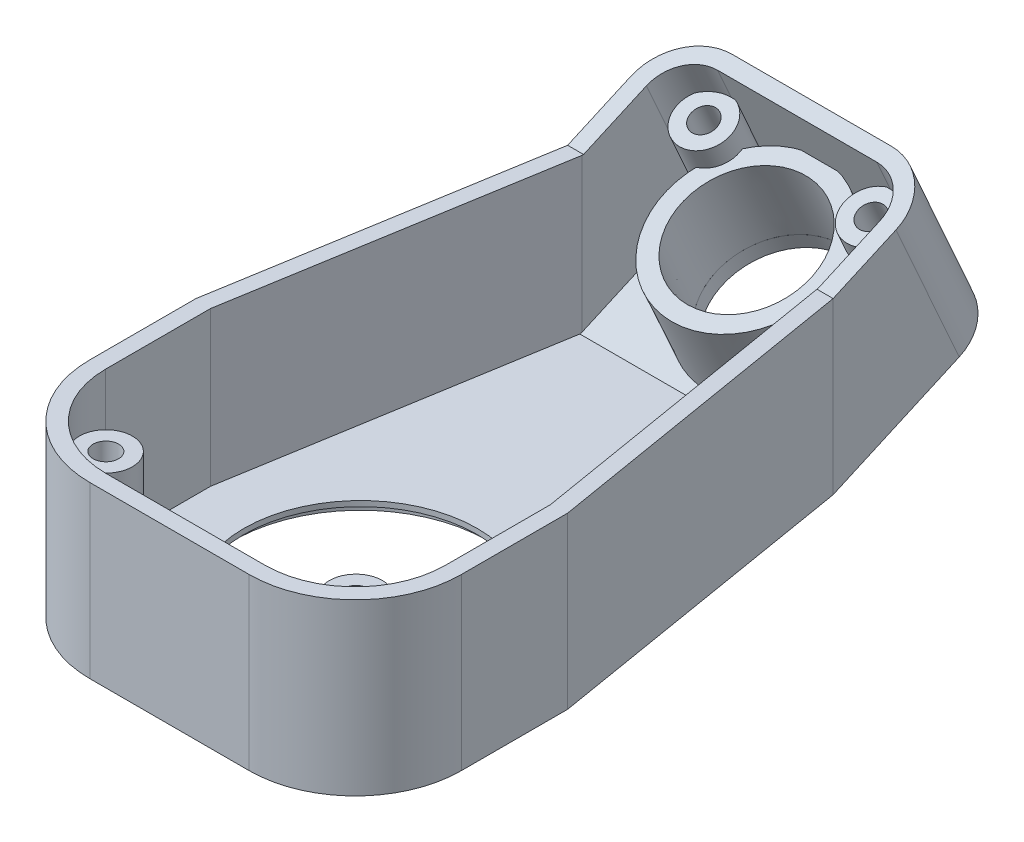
ISO-10303-21;
HEADER;
FILE_DESCRIPTION(('STEP AP214'),'2;1');
FILE_NAME('part.step','',(''),(''),'','','');
FILE_SCHEMA(('AUTOMOTIVE_DESIGN { 1 0 10303 214 1 1 1 1 }'));
ENDSEC;
DATA;
#1=APPLICATION_CONTEXT('core data for automotive mechanical design processes');
#2=APPLICATION_PROTOCOL_DEFINITION('international standard','automotive_design',2000,#1);
#3=PRODUCT_CONTEXT('',#1,'mechanical');
#4=PRODUCT('Part','Part','',(#3));
#5=PRODUCT_RELATED_PRODUCT_CATEGORY('part','',(#4));
#6=PRODUCT_DEFINITION_FORMATION('','',#4);
#7=PRODUCT_DEFINITION_CONTEXT('part definition',#1,'design');
#8=PRODUCT_DEFINITION('design','',#6,#7);
#9=PRODUCT_DEFINITION_SHAPE('','',#8);
#10=(LENGTH_UNIT() NAMED_UNIT(*) SI_UNIT(.MILLI.,.METRE.));
#11=(NAMED_UNIT(*) PLANE_ANGLE_UNIT() SI_UNIT($,.RADIAN.));
#12=(NAMED_UNIT(*) SI_UNIT($,.STERADIAN.) SOLID_ANGLE_UNIT());
#13=UNCERTAINTY_MEASURE_WITH_UNIT(LENGTH_MEASURE(1.E-05),#10,'distance_accuracy_value','');
#14=(GEOMETRIC_REPRESENTATION_CONTEXT(3) GLOBAL_UNCERTAINTY_ASSIGNED_CONTEXT((#13)) GLOBAL_UNIT_ASSIGNED_CONTEXT((#10,
#11,#12)) REPRESENTATION_CONTEXT('',''));
#15=CARTESIAN_POINT('',(0.,0.,0.));
#16=DIRECTION('',(0.,0.,1.));
#17=DIRECTION('',(1.,0.,0.));
#18=AXIS2_PLACEMENT_3D('',#15,#16,#17);
#19=CARTESIAN_POINT('',(9.62207967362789,16.2512467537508,-58.2063137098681));
#20=DIRECTION('',(0.,0.913301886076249,0.40728327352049));
#21=DIRECTION('',(0.,-0.40728327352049,0.913301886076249));
#22=AXIS2_PLACEMENT_3D('',#19,#20,#21);
#23=PLANE('',#22);
#24=CARTESIAN_POINT('',(9.62207967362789,16.2512467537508,-58.2063137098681));
#25=DIRECTION('',(0.,0.913301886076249,0.40728327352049));
#26=DIRECTION('',(0.,-0.40728327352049,0.913301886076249));
#27=AXIS2_PLACEMENT_3D('',#24,#25,#26);
#28=CIRCLE('',#27,2.5);
#29=CARTESIAN_POINT('',(9.62207967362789,15.2330385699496,-55.9230589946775));
#30=VERTEX_POINT('',#29);
#31=EDGE_CURVE('E11',#30,#30,#28,.T.);
#32=ORIENTED_EDGE('',*,*,#31,.T.);
#33=EDGE_LOOP('',(#32));
#34=FACE_BOUND('',#33,.T.);
#35=CARTESIAN_POINT('',(9.62207967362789,16.2512467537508,-58.2063137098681));
#36=DIRECTION('',(0.,0.913301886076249,0.40728327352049));
#37=DIRECTION('',(0.,-0.40728327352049,0.913301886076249));
#38=AXIS2_PLACEMENT_3D('',#35,#36,#37);
#39=CIRCLE('',#38,1.2);
#40=CARTESIAN_POINT('',(9.62207967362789,15.7625068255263,-57.1103514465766));
#41=VERTEX_POINT('',#40);
#42=EDGE_CURVE('E44',#41,#41,#39,.T.);
#43=ORIENTED_EDGE('',*,*,#42,.F.);
#44=EDGE_LOOP('',(#43));
#45=FACE_BOUND('',#44,.T.);
#46=ADVANCED_FACE('F33',(#34,#45),#23,.T.);
#47=CARTESIAN_POINT('',(9.62207967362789,7.11822789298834,-62.279146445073));
#48=DIRECTION('',(0.,0.913301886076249,0.40728327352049));
#49=DIRECTION('',(0.,-0.40728327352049,0.913301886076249));
#50=AXIS2_PLACEMENT_3D('',#47,#48,#49);
#51=PLANE('',#50);
#52=CARTESIAN_POINT('',(9.62207967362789,7.11822789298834,-62.279146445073));
#53=DIRECTION('',(0.,0.913301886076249,0.40728327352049));
#54=DIRECTION('',(0.,-0.40728327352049,0.913301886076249));
#55=AXIS2_PLACEMENT_3D('',#52,#53,#54);
#56=CIRCLE('',#55,2.5);
#57=CARTESIAN_POINT('',(9.62207967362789,6.10001970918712,-59.9958917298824));
#58=VERTEX_POINT('',#57);
#59=EDGE_CURVE('E40',#58,#58,#56,.T.);
#60=ORIENTED_EDGE('',*,*,#59,.F.);
#61=EDGE_LOOP('',(#60));
#62=FACE_BOUND('',#61,.T.);
#63=CARTESIAN_POINT('',(9.62207967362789,7.11822789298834,-62.279146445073));
#64=DIRECTION('',(0.,0.913301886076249,0.40728327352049));
#65=DIRECTION('',(0.,-0.40728327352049,0.913301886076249));
#66=AXIS2_PLACEMENT_3D('',#63,#64,#65);
#67=CIRCLE('',#66,1.2);
#68=CARTESIAN_POINT('',(9.62207967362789,6.62948796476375,-61.1831841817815));
#69=VERTEX_POINT('',#68);
#70=EDGE_CURVE('E48',#69,#69,#67,.T.);
#71=ORIENTED_EDGE('',*,*,#70,.T.);
#72=EDGE_LOOP('',(#71));
#73=FACE_BOUND('',#72,.T.);
#74=ADVANCED_FACE('F54',(#62,#73),#51,.F.);
#75=CARTESIAN_POINT('',(9.62207967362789,16.2512467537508,-58.2063137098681));
#76=DIRECTION('',(0.,-0.913301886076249,-0.40728327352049));
#77=DIRECTION('',(0.,0.40728327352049,-0.913301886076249));
#78=AXIS2_PLACEMENT_3D('',#75,#76,#77);
#79=CYLINDRICAL_SURFACE('',#78,2.5);
#80=ORIENTED_EDGE('',*,*,#31,.F.);
#81=EDGE_LOOP('',(#80));
#82=FACE_BOUND('',#81,.T.);
#83=ORIENTED_EDGE('',*,*,#59,.T.);
#84=EDGE_LOOP('',(#83));
#85=FACE_BOUND('',#84,.T.);
#86=ADVANCED_FACE('F35',(#82,#85),#79,.T.);
#87=CARTESIAN_POINT('',(9.62207967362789,16.2512467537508,-58.2063137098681));
#88=DIRECTION('',(0.,-0.913301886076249,-0.40728327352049));
#89=DIRECTION('',(0.,0.40728327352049,-0.913301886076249));
#90=AXIS2_PLACEMENT_3D('',#87,#88,#89);
#91=CYLINDRICAL_SURFACE('',#90,1.2);
#92=ORIENTED_EDGE('',*,*,#42,.T.);
#93=EDGE_LOOP('',(#92));
#94=FACE_BOUND('',#93,.T.);
#95=ORIENTED_EDGE('',*,*,#70,.F.);
#96=EDGE_LOOP('',(#95));
#97=FACE_BOUND('',#96,.T.);
#98=ADVANCED_FACE('F56',(#94,#97),#91,.F.);
#99=CLOSED_SHELL('',(#46,#74,#86,#98));
#100=MANIFOLD_SOLID_BREP('B2',#99);
#101=CARTESIAN_POINT('',(25.3779203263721,16.2512467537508,-58.2063137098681));
#102=DIRECTION('',(0.,0.913301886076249,0.40728327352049));
#103=DIRECTION('',(0.,-0.40728327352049,0.913301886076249));
#104=AXIS2_PLACEMENT_3D('',#101,#102,#103);
#105=PLANE('',#104);
#106=CARTESIAN_POINT('',(25.3779203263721,16.2512467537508,-58.2063137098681));
#107=DIRECTION('',(0.,0.913301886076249,0.40728327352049));
#108=DIRECTION('',(0.,-0.40728327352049,0.913301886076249));
#109=AXIS2_PLACEMENT_3D('',#106,#107,#108);
#110=CIRCLE('',#109,2.5);
#111=CARTESIAN_POINT('',(25.3779203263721,15.2330385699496,-55.9230589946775));
#112=VERTEX_POINT('',#111);
#113=EDGE_CURVE('E32',#112,#112,#110,.T.);
#114=ORIENTED_EDGE('',*,*,#113,.T.);
#115=EDGE_LOOP('',(#114));
#116=FACE_BOUND('',#115,.T.);
#117=CARTESIAN_POINT('',(25.3779203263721,16.2512467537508,-58.2063137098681));
#118=DIRECTION('',(0.,0.913301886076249,0.40728327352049));
#119=DIRECTION('',(0.,-0.40728327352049,0.913301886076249));
#120=AXIS2_PLACEMENT_3D('',#117,#118,#119);
#121=CIRCLE('',#120,1.2);
#122=CARTESIAN_POINT('',(25.3779203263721,15.7625068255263,-57.1103514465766));
#123=VERTEX_POINT('',#122);
#124=EDGE_CURVE('E105',#123,#123,#121,.T.);
#125=ORIENTED_EDGE('',*,*,#124,.F.);
#126=EDGE_LOOP('',(#125));
#127=FACE_BOUND('',#126,.T.);
#128=ADVANCED_FACE('F94',(#116,#127),#105,.T.);
#129=CARTESIAN_POINT('',(25.3779203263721,7.11822789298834,-62.279146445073));
#130=DIRECTION('',(0.,0.913301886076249,0.40728327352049));
#131=DIRECTION('',(0.,-0.40728327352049,0.913301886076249));
#132=AXIS2_PLACEMENT_3D('',#129,#130,#131);
#133=PLANE('',#132);
#134=CARTESIAN_POINT('',(25.3779203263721,7.11822789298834,-62.279146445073));
#135=DIRECTION('',(0.,0.913301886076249,0.40728327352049));
#136=DIRECTION('',(0.,-0.40728327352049,0.913301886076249));
#137=AXIS2_PLACEMENT_3D('',#134,#135,#136);
#138=CIRCLE('',#137,2.5);
#139=CARTESIAN_POINT('',(25.3779203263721,6.10001970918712,-59.9958917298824));
#140=VERTEX_POINT('',#139);
#141=EDGE_CURVE('E101',#140,#140,#138,.T.);
#142=ORIENTED_EDGE('',*,*,#141,.F.);
#143=EDGE_LOOP('',(#142));
#144=FACE_BOUND('',#143,.T.);
#145=CARTESIAN_POINT('',(25.3779203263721,7.11822789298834,-62.279146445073));
#146=DIRECTION('',(0.,0.913301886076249,0.40728327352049));
#147=DIRECTION('',(0.,-0.40728327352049,0.913301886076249));
#148=AXIS2_PLACEMENT_3D('',#145,#146,#147);
#149=CIRCLE('',#148,1.2);
#150=CARTESIAN_POINT('',(25.3779203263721,6.62948796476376,-61.1831841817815));
#151=VERTEX_POINT('',#150);
#152=EDGE_CURVE('E109',#151,#151,#149,.T.);
#153=ORIENTED_EDGE('',*,*,#152,.T.);
#154=EDGE_LOOP('',(#153));
#155=FACE_BOUND('',#154,.T.);
#156=ADVANCED_FACE('F115',(#144,#155),#133,.F.);
#157=CARTESIAN_POINT('',(25.3779203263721,16.2512467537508,-58.2063137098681));
#158=DIRECTION('',(0.,-0.913301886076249,-0.40728327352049));
#159=DIRECTION('',(0.,0.40728327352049,-0.913301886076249));
#160=AXIS2_PLACEMENT_3D('',#157,#158,#159);
#161=CYLINDRICAL_SURFACE('',#160,2.5);
#162=ORIENTED_EDGE('',*,*,#113,.F.);
#163=EDGE_LOOP('',(#162));
#164=FACE_BOUND('',#163,.T.);
#165=ORIENTED_EDGE('',*,*,#141,.T.);
#166=EDGE_LOOP('',(#165));
#167=FACE_BOUND('',#166,.T.);
#168=ADVANCED_FACE('F96',(#164,#167),#161,.T.);
#169=CARTESIAN_POINT('',(25.3779203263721,16.2512467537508,-58.2063137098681));
#170=DIRECTION('',(0.,-0.913301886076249,-0.40728327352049));
#171=DIRECTION('',(0.,0.40728327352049,-0.913301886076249));
#172=AXIS2_PLACEMENT_3D('',#169,#170,#171);
#173=CYLINDRICAL_SURFACE('',#172,1.2);
#174=ORIENTED_EDGE('',*,*,#124,.T.);
#175=EDGE_LOOP('',(#174));
#176=FACE_BOUND('',#175,.T.);
#177=ORIENTED_EDGE('',*,*,#152,.F.);
#178=EDGE_LOOP('',(#177));
#179=FACE_BOUND('',#178,.T.);
#180=ADVANCED_FACE('F117',(#176,#179),#173,.F.);
#181=CLOSED_SHELL('',(#128,#156,#168,#180));
#182=MANIFOLD_SOLID_BREP('B6',#181);
#183=CARTESIAN_POINT('',(17.5,12.3419173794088,-54.3505258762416));
#184=DIRECTION('',(0.,0.913301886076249,0.40728327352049));
#185=DIRECTION('',(0.,-0.40728327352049,0.913301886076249));
#186=AXIS2_PLACEMENT_3D('',#183,#184,#185);
#187=PLANE('',#186);
#188=CARTESIAN_POINT('',(17.5,12.3419173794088,-54.3505258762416));
#189=DIRECTION('',(0.,0.913301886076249,0.40728327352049));
#190=DIRECTION('',(0.,-0.40728327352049,0.913301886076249));
#191=AXIS2_PLACEMENT_3D('',#188,#189,#190);
#192=CIRCLE('',#191,7.70585144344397);
#193=CARTESIAN_POINT('',(17.5,9.20345297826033,-47.3127572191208));
#194=VERTEX_POINT('',#193);
#195=EDGE_CURVE('E93',#194,#194,#192,.T.);
#196=ORIENTED_EDGE('',*,*,#195,.T.);
#197=EDGE_LOOP('',(#196));
#198=FACE_BOUND('',#197,.T.);
#199=CARTESIAN_POINT('',(17.5,12.3419173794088,-54.3505258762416));
#200=DIRECTION('',(0.,0.913301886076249,0.40728327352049));
#201=DIRECTION('',(0.,-0.40728327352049,0.913301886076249));
#202=AXIS2_PLACEMENT_3D('',#199,#200,#201);
#203=CIRCLE('',#202,6.09414855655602);
#204=CARTESIAN_POINT('',(17.5,9.85987260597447,-48.7847285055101));
#205=VERTEX_POINT('',#204);
#206=EDGE_CURVE('E160',#205,#205,#203,.T.);
#207=ORIENTED_EDGE('',*,*,#206,.F.);
#208=EDGE_LOOP('',(#207));
#209=FACE_BOUND('',#208,.T.);
#210=ADVANCED_FACE('F156',(#198,#209),#187,.T.);
#211=CARTESIAN_POINT('',(17.5,5.03550229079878,-57.6087920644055));
#212=DIRECTION('',(0.,0.913301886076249,0.40728327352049));
#213=DIRECTION('',(0.,-0.40728327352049,0.913301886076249));
#214=AXIS2_PLACEMENT_3D('',#211,#212,#213);
#215=PLANE('',#214);
#216=CARTESIAN_POINT('',(17.5,5.03550229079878,-57.6087920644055));
#217=DIRECTION('',(0.,0.913301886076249,0.40728327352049));
#218=DIRECTION('',(0.,-0.40728327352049,0.913301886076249));
#219=AXIS2_PLACEMENT_3D('',#216,#217,#218);
#220=CIRCLE('',#219,7.65);
#221=CARTESIAN_POINT('',(17.5,1.91978524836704,-50.6220326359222));
#222=VERTEX_POINT('',#221);
#223=EDGE_CURVE('E164',#222,#222,#220,.T.);
#224=ORIENTED_EDGE('',*,*,#223,.F.);
#225=EDGE_LOOP('',(#224));
#226=FACE_BOUND('',#225,.T.);
#227=CARTESIAN_POINT('',(17.5,5.03550229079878,-57.6087920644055));
#228=DIRECTION('',(0.,0.913301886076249,0.40728327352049));
#229=DIRECTION('',(0.,-0.40728327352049,0.913301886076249));
#230=AXIS2_PLACEMENT_3D('',#227,#228,#229);
#231=CIRCLE('',#230,6.15);
#232=CARTESIAN_POINT('',(17.5,2.53071015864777,-51.9919854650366));
#233=VERTEX_POINT('',#232);
#234=EDGE_CURVE('E170',#233,#233,#231,.T.);
#235=ORIENTED_EDGE('',*,*,#234,.T.);
#236=EDGE_LOOP('',(#235));
#237=FACE_BOUND('',#236,.T.);
#238=ADVANCED_FACE('F180',(#226,#237),#215,.F.);
#239=CARTESIAN_POINT('',(17.5,5.03550229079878,-57.6087920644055));
#240=DIRECTION('',(0.,0.913301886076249,0.40728327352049));
#241=DIRECTION('',(0.,-0.40728327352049,0.913301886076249));
#242=AXIS2_PLACEMENT_3D('',#239,#240,#241);
#243=CONICAL_SURFACE('',#242,7.65,0.00698131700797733);
#244=ORIENTED_EDGE('',*,*,#195,.F.);
#245=EDGE_LOOP('',(#244));
#246=FACE_BOUND('',#245,.T.);
#247=ORIENTED_EDGE('',*,*,#223,.T.);
#248=EDGE_LOOP('',(#247));
#249=FACE_BOUND('',#248,.T.);
#250=ADVANCED_FACE('F185',(#246,#249),#243,.T.);
#251=CARTESIAN_POINT('',(17.5,5.03550229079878,-57.6087920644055));
#252=DIRECTION('',(0.,-0.913301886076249,-0.40728327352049));
#253=DIRECTION('',(0.,-0.40728327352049,0.913301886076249));
#254=AXIS2_PLACEMENT_3D('',#251,#252,#253);
#255=CONICAL_SURFACE('',#254,6.15,0.00698131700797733);
#256=ORIENTED_EDGE('',*,*,#206,.T.);
#257=EDGE_LOOP('',(#256));
#258=FACE_BOUND('',#257,.T.);
#259=ORIENTED_EDGE('',*,*,#234,.F.);
#260=EDGE_LOOP('',(#259));
#261=FACE_BOUND('',#260,.T.);
#262=ADVANCED_FACE('F158',(#258,#261),#255,.F.);
#263=CLOSED_SHELL('',(#210,#238,#250,#262));
#264=MANIFOLD_SOLID_BREP('B27',#263);
#265=CARTESIAN_POINT('',(35.,1.5,0.));
#266=DIRECTION('',(0.,1.,0.));
#267=DIRECTION('',(0.,0.,1.));
#268=AXIS2_PLACEMENT_3D('',#265,#266,#267);
#269=PLANE('',#268);
#270=CARTESIAN_POINT('',(17.5,1.5,-18.));
#271=DIRECTION('',(0.,1.,0.));
#272=DIRECTION('',(0.,0.,1.));
#273=AXIS2_PLACEMENT_3D('',#270,#271,#272);
#274=CIRCLE('',#273,11.);
#275=CARTESIAN_POINT('',(17.5,1.5,-29.));
#276=VERTEX_POINT('',#275);
#277=EDGE_CURVE('E438',#276,#276,#274,.T.);
#278=ORIENTED_EDGE('',*,*,#277,.F.);
#279=EDGE_LOOP('',(#278));
#280=FACE_BOUND('',#279,.T.);
#281=CARTESIAN_POINT('',(10.,1.5,-10.));
#282=DIRECTION('',(0.,1.,0.));
#283=DIRECTION('',(0.,0.,1.));
#284=AXIS2_PLACEMENT_3D('',#281,#282,#283);
#285=CIRCLE('',#284,8.5);
#286=CARTESIAN_POINT('',(3.89930943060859,1.5,-4.08125227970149));
#287=VERTEX_POINT('',#286);
#288=CARTESIAN_POINT('',(1.5,1.5,-10.));
#289=VERTEX_POINT('',#288);
#290=EDGE_CURVE('E469',#287,#289,#285,.F.);
#291=ORIENTED_EDGE('',*,*,#290,.F.);
#292=CARTESIAN_POINT('',(5.72495602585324,1.5,-5.78917924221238));
#293=DIRECTION('',(0.,1.,0.));
#294=DIRECTION('',(0.,0.,1.));
#295=AXIS2_PLACEMENT_3D('',#292,#293,#294);
#296=CIRCLE('',#295,2.50000000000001);
#297=CARTESIAN_POINT('',(3.98959235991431,1.5,-3.98959235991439));
#298=VERTEX_POINT('',#297);
#299=EDGE_CURVE('E413',#298,#287,#296,.T.);
#300=ORIENTED_EDGE('',*,*,#299,.F.);
#301=CARTESIAN_POINT('',(10.,1.5,-1.5));
#302=VERTEX_POINT('',#301);
#303=EDGE_CURVE('E474',#302,#298,#285,.F.);
#304=ORIENTED_EDGE('',*,*,#303,.F.);
#305=DIRECTION('',(-1.,0.,0.));
#306=VECTOR('',#305,1.);
#307=CARTESIAN_POINT('',(35.,1.5,-1.5));
#308=LINE('',#307,#306);
#309=CARTESIAN_POINT('',(25.,1.5,-1.5));
#310=VERTEX_POINT('',#309);
#311=EDGE_CURVE('E455',#310,#302,#308,.T.);
#312=ORIENTED_EDGE('',*,*,#311,.F.);
#313=CARTESIAN_POINT('',(25.,1.5,-10.));
#314=DIRECTION('',(0.,1.,0.));
#315=DIRECTION('',(0.,0.,1.));
#316=AXIS2_PLACEMENT_3D('',#313,#314,#315);
#317=CIRCLE('',#316,8.5);
#318=CARTESIAN_POINT('',(31.0104076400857,1.5,-3.98959235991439));
#319=VERTEX_POINT('',#318);
#320=EDGE_CURVE('E470',#319,#310,#317,.F.);
#321=ORIENTED_EDGE('',*,*,#320,.F.);
#322=CARTESIAN_POINT('',(29.2750439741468,1.5,-5.78917924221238));
#323=DIRECTION('',(0.,1.,0.));
#324=DIRECTION('',(0.,0.,1.));
#325=AXIS2_PLACEMENT_3D('',#322,#323,#324);
#326=CIRCLE('',#325,2.5);
#327=CARTESIAN_POINT('',(31.1006905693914,1.5,-4.0812522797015));
#328=VERTEX_POINT('',#327);
#329=EDGE_CURVE('E420',#328,#319,#326,.T.);
#330=ORIENTED_EDGE('',*,*,#329,.F.);
#331=CARTESIAN_POINT('',(33.5,1.5,-10.));
#332=VERTEX_POINT('',#331);
#333=EDGE_CURVE('E467',#332,#328,#317,.F.);
#334=ORIENTED_EDGE('',*,*,#333,.F.);
#335=DIRECTION('',(0.,0.,-1.));
#336=VECTOR('',#335,1.);
#337=CARTESIAN_POINT('',(33.5,1.5,0.));
#338=LINE('',#337,#336);
#339=CARTESIAN_POINT('',(33.5,1.5,-19.8758562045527));
#340=VERTEX_POINT('',#339);
#341=EDGE_CURVE('E462',#332,#340,#338,.T.);
#342=ORIENTED_EDGE('',*,*,#341,.T.);
#343=DIRECTION('',(0.164398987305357,0.,0.986393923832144));
#344=VECTOR('',#343,1.);
#345=CARTESIAN_POINT('',(33.5204091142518,1.5,-19.753401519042));
#346=LINE('',#345,#344);
#347=CARTESIAN_POINT('',(28.5325266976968,1.5,-49.6806960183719));
#348=VERTEX_POINT('',#347);
#349=EDGE_CURVE('E457',#348,#340,#346,.T.);
#350=ORIENTED_EDGE('',*,*,#349,.F.);
#351=DIRECTION('',(-1.,0.,0.));
#352=VECTOR('',#351,1.);
#353=CARTESIAN_POINT('',(35.,1.5,-49.6806960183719));
#354=LINE('',#353,#352);
#355=CARTESIAN_POINT('',(6.4674733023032,1.5,-49.6806960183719));
#356=VERTEX_POINT('',#355);
#357=EDGE_CURVE('E453',#348,#356,#354,.T.);
#358=ORIENTED_EDGE('',*,*,#357,.T.);
#359=DIRECTION('',(0.164398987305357,0.,-0.986393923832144));
#360=VECTOR('',#359,1.);
#361=CARTESIAN_POINT('',(1.47959088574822,1.5,-19.753401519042));
#362=LINE('',#361,#360);
#363=CARTESIAN_POINT('',(1.5,1.5,-19.8758562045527));
#364=VERTEX_POINT('',#363);
#365=EDGE_CURVE('E448',#364,#356,#362,.T.);
#366=ORIENTED_EDGE('',*,*,#365,.F.);
#367=DIRECTION('',(0.,0.,-1.));
#368=VECTOR('',#367,1.);
#369=CARTESIAN_POINT('',(1.5,1.5,0.));
#370=LINE('',#369,#368);
#371=EDGE_CURVE('E477',#289,#364,#370,.T.);
#372=ORIENTED_EDGE('',*,*,#371,.F.);
#373=EDGE_LOOP('',(#291,#300,#304,#312,#321,#330,#334,#342,#350,#358,#366,#372));
#374=FACE_BOUND('',#373,.T.);
#375=ADVANCED_FACE('F210',(#280,#374),#269,.T.);
#376=CARTESIAN_POINT('',(10.,0.,-10.));
#377=DIRECTION('',(0.,1.,0.));
#378=DIRECTION('',(0.,0.,1.));
#379=AXIS2_PLACEMENT_3D('',#376,#377,#378);
#380=CYLINDRICAL_SURFACE('',#379,8.5);
#381=DIRECTION('',(0.,-1.,0.));
#382=VECTOR('',#381,1.);
#383=CARTESIAN_POINT('',(3.98959235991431,7.5,-3.98959235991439));
#384=LINE('',#383,#382);
#385=CARTESIAN_POINT('',(3.98959235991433,13.5,-3.98959235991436));
#386=VERTEX_POINT('',#385);
#387=EDGE_CURVE('E218',#386,#298,#384,.T.);
#388=ORIENTED_EDGE('',*,*,#387,.F.);
#389=CARTESIAN_POINT('',(10.,13.5,-10.));
#390=DIRECTION('',(0.,1.,0.));
#391=DIRECTION('',(0.,0.,1.));
#392=AXIS2_PLACEMENT_3D('',#389,#390,#391);
#393=CIRCLE('',#392,8.5);
#394=CARTESIAN_POINT('',(3.89930943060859,13.5,-4.08125227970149));
#395=VERTEX_POINT('',#394);
#396=EDGE_CURVE('E403',#386,#395,#393,.F.);
#397=ORIENTED_EDGE('',*,*,#396,.T.);
#398=DIRECTION('',(0.,-1.,0.));
#399=VECTOR('',#398,1.);
#400=CARTESIAN_POINT('',(3.89930943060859,7.5,-4.08125227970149));
#401=LINE('',#400,#399);
#402=EDGE_CURVE('E230',#287,#395,#401,.F.);
#403=ORIENTED_EDGE('',*,*,#402,.F.);
#404=ORIENTED_EDGE('',*,*,#290,.T.);
#405=DIRECTION('',(0.,1.,0.));
#406=VECTOR('',#405,1.);
#407=CARTESIAN_POINT('',(1.5,16.,-10.));
#408=LINE('',#407,#406);
#409=CARTESIAN_POINT('',(1.5,16.,-10.));
#410=VERTEX_POINT('',#409);
#411=EDGE_CURVE('E476',#289,#410,#408,.T.);
#412=ORIENTED_EDGE('',*,*,#411,.T.);
#413=CARTESIAN_POINT('',(10.,16.,-10.));
#414=DIRECTION('',(0.,-1.,0.));
#415=DIRECTION('',(0.,0.,-1.));
#416=AXIS2_PLACEMENT_3D('',#413,#414,#415);
#417=CIRCLE('',#416,8.5);
#418=CARTESIAN_POINT('',(10.,16.,-1.5));
#419=VERTEX_POINT('',#418);
#420=EDGE_CURVE('E496',#410,#419,#417,.F.);
#421=ORIENTED_EDGE('',*,*,#420,.T.);
#422=DIRECTION('',(0.,1.,0.));
#423=VECTOR('',#422,1.);
#424=CARTESIAN_POINT('',(10.,0.,-1.5));
#425=LINE('',#424,#423);
#426=EDGE_CURVE('E489',#419,#302,#425,.F.);
#427=ORIENTED_EDGE('',*,*,#426,.T.);
#428=ORIENTED_EDGE('',*,*,#303,.T.);
#429=EDGE_LOOP('',(#388,#397,#403,#404,#412,#421,#427,#428));
#430=FACE_BOUND('',#429,.T.);
#431=ADVANCED_FACE('F404',(#430),#380,.F.);
#432=CARTESIAN_POINT('',(25.,16.,-10.));
#433=DIRECTION('',(0.,-1.,0.));
#434=DIRECTION('',(0.,0.,-1.));
#435=AXIS2_PLACEMENT_3D('',#432,#433,#434);
#436=CYLINDRICAL_SURFACE('',#435,8.5);
#437=DIRECTION('',(0.,-1.,0.));
#438=VECTOR('',#437,1.);
#439=CARTESIAN_POINT('',(31.0104076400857,7.5,-3.98959235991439));
#440=LINE('',#439,#438);
#441=CARTESIAN_POINT('',(31.0104076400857,13.5,-3.98959235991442));
#442=VERTEX_POINT('',#441);
#443=EDGE_CURVE('E661',#319,#442,#440,.F.);
#444=ORIENTED_EDGE('',*,*,#443,.F.);
#445=ORIENTED_EDGE('',*,*,#320,.T.);
#446=DIRECTION('',(0.,1.,0.));
#447=VECTOR('',#446,1.);
#448=CARTESIAN_POINT('',(25.,0.,-1.5));
#449=LINE('',#448,#447);
#450=CARTESIAN_POINT('',(25.,16.,-1.5));
#451=VERTEX_POINT('',#450);
#452=EDGE_CURVE('E473',#310,#451,#449,.T.);
#453=ORIENTED_EDGE('',*,*,#452,.T.);
#454=CARTESIAN_POINT('',(25.,16.,-10.));
#455=DIRECTION('',(0.,-1.,0.));
#456=DIRECTION('',(0.,0.,-1.));
#457=AXIS2_PLACEMENT_3D('',#454,#455,#456);
#458=CIRCLE('',#457,8.5);
#459=CARTESIAN_POINT('',(33.5,16.,-10.));
#460=VERTEX_POINT('',#459);
#461=EDGE_CURVE('E488',#451,#460,#458,.F.);
#462=ORIENTED_EDGE('',*,*,#461,.T.);
#463=DIRECTION('',(0.,1.,0.));
#464=VECTOR('',#463,1.);
#465=CARTESIAN_POINT('',(33.5,16.,-10.));
#466=LINE('',#465,#464);
#467=EDGE_CURVE('E493',#460,#332,#466,.F.);
#468=ORIENTED_EDGE('',*,*,#467,.T.);
#469=ORIENTED_EDGE('',*,*,#333,.T.);
#470=DIRECTION('',(0.,-1.,0.));
#471=VECTOR('',#470,1.);
#472=CARTESIAN_POINT('',(31.1006905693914,7.5,-4.0812522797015));
#473=LINE('',#472,#471);
#474=CARTESIAN_POINT('',(31.1006905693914,13.5,-4.0812522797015));
#475=VERTEX_POINT('',#474);
#476=EDGE_CURVE('E654',#475,#328,#473,.T.);
#477=ORIENTED_EDGE('',*,*,#476,.F.);
#478=CARTESIAN_POINT('',(25.,13.5,-10.));
#479=DIRECTION('',(0.,1.,0.));
#480=DIRECTION('',(0.,0.,1.));
#481=AXIS2_PLACEMENT_3D('',#478,#479,#480);
#482=CIRCLE('',#481,8.5);
#483=EDGE_CURVE('E659',#475,#442,#482,.F.);
#484=ORIENTED_EDGE('',*,*,#483,.T.);
#485=EDGE_LOOP('',(#444,#445,#453,#462,#468,#469,#477,#484));
#486=FACE_BOUND('',#485,.T.);
#487=ADVANCED_FACE('F818',(#486),#436,.F.);
#488=CARTESIAN_POINT('',(35.,16.,0.));
#489=DIRECTION('',(0.,-1.,0.));
#490=DIRECTION('',(0.,0.,-1.));
#491=AXIS2_PLACEMENT_3D('',#488,#489,#490);
#492=PLANE('',#491);
#493=DIRECTION('',(0.,0.,-1.));
#494=VECTOR('',#493,1.);
#495=CARTESIAN_POINT('',(28.5,16.,0.));
#496=LINE('',#495,#494);
#497=CARTESIAN_POINT('',(28.5,16.,-49.8758562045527));
#498=VERTEX_POINT('',#497);
#499=CARTESIAN_POINT('',(28.5,16.,-50.));
#500=VERTEX_POINT('',#499);
#501=EDGE_CURVE('E532',#498,#500,#496,.T.);
#502=ORIENTED_EDGE('',*,*,#501,.F.);
#503=DIRECTION('',(0.164398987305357,0.,0.986393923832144));
#504=VECTOR('',#503,1.);
#505=CARTESIAN_POINT('',(36.763652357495,16.,-0.293942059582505));
#506=LINE('',#505,#504);
#507=CARTESIAN_POINT('',(33.5,16.,-19.8758562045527));
#508=VERTEX_POINT('',#507);
#509=EDGE_CURVE('E480',#498,#508,#506,.T.);
#510=ORIENTED_EDGE('',*,*,#509,.T.);
#511=DIRECTION('',(0.,0.,1.));
#512=VECTOR('',#511,1.);
#513=CARTESIAN_POINT('',(33.5,16.,0.));
#514=LINE('',#513,#512);
#515=EDGE_CURVE('E465',#508,#460,#514,.T.);
#516=ORIENTED_EDGE('',*,*,#515,.T.);
#517=ORIENTED_EDGE('',*,*,#461,.F.);
#518=DIRECTION('',(-1.,0.,0.));
#519=VECTOR('',#518,1.);
#520=CARTESIAN_POINT('',(35.,16.,-1.5));
#521=LINE('',#520,#519);
#522=EDGE_CURVE('E535',#451,#419,#521,.T.);
#523=ORIENTED_EDGE('',*,*,#522,.T.);
#524=ORIENTED_EDGE('',*,*,#420,.F.);
#525=DIRECTION('',(0.,0.,1.));
#526=VECTOR('',#525,1.);
#527=CARTESIAN_POINT('',(1.5,16.,0.));
#528=LINE('',#527,#526);
#529=CARTESIAN_POINT('',(1.5,16.,-19.8758562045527));
#530=VERTEX_POINT('',#529);
#531=EDGE_CURVE('E466',#530,#410,#528,.T.);
#532=ORIENTED_EDGE('',*,*,#531,.F.);
#533=DIRECTION('',(0.164398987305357,0.,-0.986393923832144));
#534=VECTOR('',#533,1.);
#535=CARTESIAN_POINT('',(-0.817706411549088,16.,-5.96961773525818));
#536=LINE('',#535,#534);
#537=CARTESIAN_POINT('',(6.5,16.,-49.8758562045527));
#538=VERTEX_POINT('',#537);
#539=EDGE_CURVE('E461',#530,#538,#536,.T.);
#540=ORIENTED_EDGE('',*,*,#539,.T.);
#541=DIRECTION('',(0.,0.,-1.));
#542=VECTOR('',#541,1.);
#543=CARTESIAN_POINT('',(6.5,16.,-50.));
#544=LINE('',#543,#542);
#545=CARTESIAN_POINT('',(6.5,16.,-50.));
#546=VERTEX_POINT('',#545);
#547=EDGE_CURVE('E552',#538,#546,#544,.T.);
#548=ORIENTED_EDGE('',*,*,#547,.T.);
#549=DIRECTION('',(-1.,0.,0.));
#550=VECTOR('',#549,1.);
#551=CARTESIAN_POINT('',(35.,16.,-50.));
#552=LINE('',#551,#550);
#553=CARTESIAN_POINT('',(5.,16.,-50.));
#554=VERTEX_POINT('',#553);
#555=EDGE_CURVE('E595',#546,#554,#552,.T.);
#556=ORIENTED_EDGE('',*,*,#555,.T.);
#557=DIRECTION('',(0.164398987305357,0.,-0.986393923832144));
#558=VECTOR('',#557,1.);
#559=CARTESIAN_POINT('',(-2.2972972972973,16.,-6.21621621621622));
#560=LINE('',#559,#558);
#561=CARTESIAN_POINT('',(0.,16.,-20.));
#562=VERTEX_POINT('',#561);
#563=EDGE_CURVE('E572',#562,#554,#560,.T.);
#564=ORIENTED_EDGE('',*,*,#563,.F.);
#565=DIRECTION('',(0.,0.,1.));
#566=VECTOR('',#565,1.);
#567=CARTESIAN_POINT('',(0.,16.,0.));
#568=LINE('',#567,#566);
#569=CARTESIAN_POINT('',(0.,16.,-10.));
#570=VERTEX_POINT('',#569);
#571=EDGE_CURVE('E585',#562,#570,#568,.T.);
#572=ORIENTED_EDGE('',*,*,#571,.T.);
#573=CARTESIAN_POINT('',(10.,16.,-10.));
#574=DIRECTION('',(0.,-1.,0.));
#575=DIRECTION('',(0.,0.,-1.));
#576=AXIS2_PLACEMENT_3D('',#573,#574,#575);
#577=CIRCLE('',#576,10.);
#578=CARTESIAN_POINT('',(10.,16.,0.));
#579=VERTEX_POINT('',#578);
#580=EDGE_CURVE('E626',#570,#579,#577,.F.);
#581=ORIENTED_EDGE('',*,*,#580,.T.);
#582=DIRECTION('',(-1.,0.,0.));
#583=VECTOR('',#582,1.);
#584=CARTESIAN_POINT('',(35.,16.,0.));
#585=LINE('',#584,#583);
#586=CARTESIAN_POINT('',(25.,16.,0.));
#587=VERTEX_POINT('',#586);
#588=EDGE_CURVE('E592',#587,#579,#585,.T.);
#589=ORIENTED_EDGE('',*,*,#588,.F.);
#590=CARTESIAN_POINT('',(25.,16.,-10.));
#591=DIRECTION('',(0.,-1.,0.));
#592=DIRECTION('',(0.,0.,-1.));
#593=AXIS2_PLACEMENT_3D('',#590,#591,#592);
#594=CIRCLE('',#593,10.);
#595=CARTESIAN_POINT('',(35.,16.,-10.));
#596=VERTEX_POINT('',#595);
#597=EDGE_CURVE('E623',#587,#596,#594,.F.);
#598=ORIENTED_EDGE('',*,*,#597,.T.);
#599=DIRECTION('',(0.,0.,1.));
#600=VECTOR('',#599,1.);
#601=CARTESIAN_POINT('',(35.,16.,0.));
#602=LINE('',#601,#600);
#603=CARTESIAN_POINT('',(35.,16.,-20.));
#604=VERTEX_POINT('',#603);
#605=EDGE_CURVE('E590',#604,#596,#602,.T.);
#606=ORIENTED_EDGE('',*,*,#605,.F.);
#607=DIRECTION('',(0.164398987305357,0.,0.986393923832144));
#608=VECTOR('',#607,1.);
#609=CARTESIAN_POINT('',(38.2432432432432,16.,-0.540540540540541));
#610=LINE('',#609,#608);
#611=CARTESIAN_POINT('',(30.,16.,-50.));
#612=VERTEX_POINT('',#611);
#613=EDGE_CURVE('E580',#612,#604,#610,.T.);
#614=ORIENTED_EDGE('',*,*,#613,.F.);
#615=EDGE_CURVE('E596',#612,#500,#552,.T.);
#616=ORIENTED_EDGE('',*,*,#615,.T.);
#617=EDGE_LOOP('',(#502,#510,#516,#517,#523,#524,#532,#540,#548,#556,#564,#572,#581,#589,#598,
#606,#614,#616));
#618=FACE_BOUND('',#617,.T.);
#619=ADVANCED_FACE('F779',(#618),#492,.F.);
#620=CARTESIAN_POINT('',(35.,20.6770242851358,-60.4878726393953));
#621=DIRECTION('',(0.,-0.913301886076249,-0.40728327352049));
#622=DIRECTION('',(0.,0.40728327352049,-0.913301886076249));
#623=AXIS2_PLACEMENT_3D('',#620,#621,#622);
#624=PLANE('',#623);
#625=DIRECTION('',(0.,-0.40728327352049,0.913301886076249));
#626=VECTOR('',#625,1.);
#627=CARTESIAN_POINT('',(6.5,20.6770242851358,-60.4878726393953));
#628=LINE('',#627,#626);
#629=CARTESIAN_POINT('',(6.5,18.6406079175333,-55.9213632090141));
#630=VERTEX_POINT('',#629);
#631=EDGE_CURVE('E502',#630,#546,#628,.T.);
#632=ORIENTED_EDGE('',*,*,#631,.F.);
#633=CARTESIAN_POINT('',(10.,18.6406079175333,-55.9213632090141));
#634=DIRECTION('',(0.,-0.913301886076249,-0.40728327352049));
#635=DIRECTION('',(0.,0.40728327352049,-0.913301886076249));
#636=AXIS2_PLACEMENT_3D('',#633,#634,#635);
#637=CIRCLE('',#636,3.5);
#638=CARTESIAN_POINT('',(10.,20.066099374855,-59.117919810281));
#639=VERTEX_POINT('',#638);
#640=EDGE_CURVE('E521',#639,#630,#637,.F.);
#641=ORIENTED_EDGE('',*,*,#640,.F.);
#642=DIRECTION('',(-1.,0.,0.));
#643=VECTOR('',#642,1.);
#644=CARTESIAN_POINT('',(35.,20.066099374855,-59.117919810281));
#645=LINE('',#644,#643);
#646=CARTESIAN_POINT('',(25.,20.066099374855,-59.117919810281));
#647=VERTEX_POINT('',#646);
#648=EDGE_CURVE('E509',#647,#639,#645,.T.);
#649=ORIENTED_EDGE('',*,*,#648,.F.);
#650=CARTESIAN_POINT('',(25.,18.6406079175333,-55.9213632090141));
#651=DIRECTION('',(0.,-0.913301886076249,-0.40728327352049));
#652=DIRECTION('',(0.,0.40728327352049,-0.913301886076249));
#653=AXIS2_PLACEMENT_3D('',#650,#651,#652);
#654=CIRCLE('',#653,3.5);
#655=CARTESIAN_POINT('',(28.5,18.6406079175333,-55.9213632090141));
#656=VERTEX_POINT('',#655);
#657=EDGE_CURVE('E517',#656,#647,#654,.F.);
#658=ORIENTED_EDGE('',*,*,#657,.F.);
#659=DIRECTION('',(0.,0.40728327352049,-0.913301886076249));
#660=VECTOR('',#659,1.);
#661=CARTESIAN_POINT('',(28.5,20.6770242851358,-60.4878726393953));
#662=LINE('',#661,#660);
#663=EDGE_CURVE('E452',#500,#656,#662,.T.);
#664=ORIENTED_EDGE('',*,*,#663,.F.);
#665=ORIENTED_EDGE('',*,*,#615,.F.);
#666=DIRECTION('',(0.,0.40728327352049,-0.913301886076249));
#667=VECTOR('',#666,1.);
#668=CARTESIAN_POINT('',(30.,20.6770242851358,-60.4878726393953));
#669=LINE('',#668,#667);
#670=CARTESIAN_POINT('',(30.,18.6406079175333,-55.9213632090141));
#671=VERTEX_POINT('',#670);
#672=EDGE_CURVE('E563',#612,#671,#669,.T.);
#673=ORIENTED_EDGE('',*,*,#672,.T.);
#674=CARTESIAN_POINT('',(25.,18.6406079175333,-55.9213632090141));
#675=DIRECTION('',(0.,-0.913301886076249,-0.40728327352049));
#676=DIRECTION('',(0.,0.40728327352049,-0.913301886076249));
#677=AXIS2_PLACEMENT_3D('',#674,#675,#676);
#678=CIRCLE('',#677,5.);
#679=CARTESIAN_POINT('',(25.,20.6770242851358,-60.4878726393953));
#680=VERTEX_POINT('',#679);
#681=EDGE_CURVE('E642',#671,#680,#678,.F.);
#682=ORIENTED_EDGE('',*,*,#681,.T.);
#683=DIRECTION('',(-1.,0.,0.));
#684=VECTOR('',#683,1.);
#685=CARTESIAN_POINT('',(35.,20.6770242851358,-60.4878726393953));
#686=LINE('',#685,#684);
#687=CARTESIAN_POINT('',(10.,20.6770242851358,-60.4878726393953));
#688=VERTEX_POINT('',#687);
#689=EDGE_CURVE('E599',#680,#688,#686,.T.);
#690=ORIENTED_EDGE('',*,*,#689,.T.);
#691=CARTESIAN_POINT('',(10.,18.6406079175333,-55.9213632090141));
#692=DIRECTION('',(0.,-0.913301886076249,-0.40728327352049));
#693=DIRECTION('',(0.,0.40728327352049,-0.913301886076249));
#694=AXIS2_PLACEMENT_3D('',#691,#692,#693);
#695=CIRCLE('',#694,5.);
#696=CARTESIAN_POINT('',(5.,18.6406079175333,-55.9213632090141));
#697=VERTEX_POINT('',#696);
#698=EDGE_CURVE('E644',#688,#697,#695,.F.);
#699=ORIENTED_EDGE('',*,*,#698,.T.);
#700=DIRECTION('',(0.,-0.40728327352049,0.913301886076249));
#701=VECTOR('',#700,1.);
#702=CARTESIAN_POINT('',(5.,20.6770242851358,-60.4878726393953));
#703=LINE('',#702,#701);
#704=EDGE_CURVE('E557',#697,#554,#703,.T.);
#705=ORIENTED_EDGE('',*,*,#704,.T.);
#706=ORIENTED_EDGE('',*,*,#555,.F.);
#707=EDGE_LOOP('',(#632,#641,#649,#658,#664,#665,#673,#682,#690,#699,#705,#706));
#708=FACE_BOUND('',#707,.T.);
#709=ADVANCED_FACE('F738',(#708),#624,.F.);
#710=CARTESIAN_POINT('',(35.,0.,0.));
#711=DIRECTION('',(0.,1.,0.));
#712=DIRECTION('',(0.,0.,1.));
#713=AXIS2_PLACEMENT_3D('',#710,#711,#712);
#714=PLANE('',#713);
#715=CARTESIAN_POINT('',(17.5,0.,-18.));
#716=DIRECTION('',(0.,-1.,0.));
#717=DIRECTION('',(0.,0.,-1.));
#718=AXIS2_PLACEMENT_3D('',#715,#716,#717);
#719=CIRCLE('',#718,12.);
#720=CARTESIAN_POINT('',(17.5,0.,-30.));
#721=VERTEX_POINT('',#720);
#722=EDGE_CURVE('E441',#721,#721,#719,.T.);
#723=ORIENTED_EDGE('',*,*,#722,.F.);
#724=EDGE_LOOP('',(#723));
#725=FACE_BOUND('',#724,.T.);
#726=DIRECTION('',(0.164398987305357,0.,-0.986393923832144));
#727=VECTOR('',#726,1.);
#728=CARTESIAN_POINT('',(0.,0.,-20.));
#729=LINE('',#728,#727);
#730=CARTESIAN_POINT('',(0.,0.,-20.));
#731=VERTEX_POINT('',#730);
#732=CARTESIAN_POINT('',(5.,0.,-50.));
#733=VERTEX_POINT('',#732);
#734=EDGE_CURVE('E566',#731,#733,#729,.T.);
#735=ORIENTED_EDGE('',*,*,#734,.T.);
#736=DIRECTION('',(-1.,0.,0.));
#737=VECTOR('',#736,1.);
#738=CARTESIAN_POINT('',(35.,0.,-50.));
#739=LINE('',#738,#737);
#740=CARTESIAN_POINT('',(30.,0.,-50.));
#741=VERTEX_POINT('',#740);
#742=EDGE_CURVE('E605',#741,#733,#739,.T.);
#743=ORIENTED_EDGE('',*,*,#742,.F.);
#744=DIRECTION('',(0.164398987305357,0.,0.986393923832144));
#745=VECTOR('',#744,1.);
#746=CARTESIAN_POINT('',(35.,0.,-20.));
#747=LINE('',#746,#745);
#748=CARTESIAN_POINT('',(35.,0.,-20.));
#749=VERTEX_POINT('',#748);
#750=EDGE_CURVE('E575',#741,#749,#747,.T.);
#751=ORIENTED_EDGE('',*,*,#750,.T.);
#752=DIRECTION('',(0.,0.,-1.));
#753=VECTOR('',#752,1.);
#754=CARTESIAN_POINT('',(35.,0.,0.));
#755=LINE('',#754,#753);
#756=CARTESIAN_POINT('',(35.,0.,-10.));
#757=VERTEX_POINT('',#756);
#758=EDGE_CURVE('E587',#757,#749,#755,.T.);
#759=ORIENTED_EDGE('',*,*,#758,.F.);
#760=CARTESIAN_POINT('',(25.,0.,-10.));
#761=DIRECTION('',(0.,1.,0.));
#762=DIRECTION('',(0.,0.,1.));
#763=AXIS2_PLACEMENT_3D('',#760,#761,#762);
#764=CIRCLE('',#763,10.);
#765=CARTESIAN_POINT('',(25.,0.,0.));
#766=VERTEX_POINT('',#765);
#767=EDGE_CURVE('E616',#757,#766,#764,.F.);
#768=ORIENTED_EDGE('',*,*,#767,.T.);
#769=DIRECTION('',(-1.,0.,0.));
#770=VECTOR('',#769,1.);
#771=CARTESIAN_POINT('',(35.,0.,0.));
#772=LINE('',#771,#770);
#773=CARTESIAN_POINT('',(10.,0.,0.));
#774=VERTEX_POINT('',#773);
#775=EDGE_CURVE('E608',#766,#774,#772,.T.);
#776=ORIENTED_EDGE('',*,*,#775,.T.);
#777=CARTESIAN_POINT('',(10.,0.,-10.));
#778=DIRECTION('',(0.,1.,0.));
#779=DIRECTION('',(0.,0.,1.));
#780=AXIS2_PLACEMENT_3D('',#777,#778,#779);
#781=CIRCLE('',#780,10.);
#782=CARTESIAN_POINT('',(0.,0.,-10.));
#783=VERTEX_POINT('',#782);
#784=EDGE_CURVE('E618',#774,#783,#781,.F.);
#785=ORIENTED_EDGE('',*,*,#784,.T.);
#786=DIRECTION('',(0.,0.,-1.));
#787=VECTOR('',#786,1.);
#788=CARTESIAN_POINT('',(0.,0.,0.));
#789=LINE('',#788,#787);
#790=EDGE_CURVE('E582',#783,#731,#789,.T.);
#791=ORIENTED_EDGE('',*,*,#790,.T.);
#792=EDGE_LOOP('',(#735,#743,#751,#759,#768,#776,#785,#791));
#793=FACE_BOUND('',#792,.T.);
#794=ADVANCED_FACE('F735',(#725,#793),#714,.F.);
#795=CARTESIAN_POINT('',(0.,16.,0.));
#796=DIRECTION('',(-1.,0.,0.));
#797=DIRECTION('',(0.,0.,1.));
#798=AXIS2_PLACEMENT_3D('',#795,#796,#797);
#799=PLANE('',#798);
#800=ORIENTED_EDGE('',*,*,#571,.F.);
#801=DIRECTION('',(0.,-1.,0.));
#802=VECTOR('',#801,1.);
#803=CARTESIAN_POINT('',(0.,16.,-20.));
#804=LINE('',#803,#802);
#805=EDGE_CURVE('E633',#562,#731,#804,.T.);
#806=ORIENTED_EDGE('',*,*,#805,.T.);
#807=ORIENTED_EDGE('',*,*,#790,.F.);
#808=DIRECTION('',(0.,-1.,0.));
#809=VECTOR('',#808,1.);
#810=CARTESIAN_POINT('',(0.,16.,-10.));
#811=LINE('',#810,#809);
#812=EDGE_CURVE('E620',#783,#570,#811,.F.);
#813=ORIENTED_EDGE('',*,*,#812,.T.);
#814=EDGE_LOOP('',(#800,#806,#807,#813));
#815=FACE_BOUND('',#814,.T.);
#816=ADVANCED_FACE('F737',(#815),#799,.T.);
#817=CARTESIAN_POINT('',(35.,16.,0.));
#818=DIRECTION('',(-1.,0.,0.));
#819=DIRECTION('',(0.,0.,1.));
#820=AXIS2_PLACEMENT_3D('',#817,#818,#819);
#821=PLANE('',#820);
#822=DIRECTION('',(0.,-1.,0.));
#823=VECTOR('',#822,1.);
#824=CARTESIAN_POINT('',(35.,16.,-20.));
#825=LINE('',#824,#823);
#826=EDGE_CURVE('E631',#604,#749,#825,.T.);
#827=ORIENTED_EDGE('',*,*,#826,.F.);
#828=ORIENTED_EDGE('',*,*,#605,.T.);
#829=DIRECTION('',(0.,-1.,0.));
#830=VECTOR('',#829,1.);
#831=CARTESIAN_POINT('',(35.,16.,-10.));
#832=LINE('',#831,#830);
#833=EDGE_CURVE('E628',#596,#757,#832,.T.);
#834=ORIENTED_EDGE('',*,*,#833,.T.);
#835=ORIENTED_EDGE('',*,*,#758,.T.);
#836=EDGE_LOOP('',(#827,#828,#834,#835));
#837=FACE_BOUND('',#836,.T.);
#838=ADVANCED_FACE('F758',(#837),#821,.F.);
#839=CARTESIAN_POINT('',(35.,0.,0.));
#840=DIRECTION('',(0.,0.,-1.));
#841=DIRECTION('',(-1.,0.,0.));
#842=AXIS2_PLACEMENT_3D('',#839,#840,#841);
#843=PLANE('',#842);
#844=ORIENTED_EDGE('',*,*,#588,.T.);
#845=DIRECTION('',(0.,-1.,0.));
#846=VECTOR('',#845,1.);
#847=CARTESIAN_POINT('',(10.,0.,0.));
#848=LINE('',#847,#846);
#849=EDGE_CURVE('E613',#579,#774,#848,.T.);
#850=ORIENTED_EDGE('',*,*,#849,.T.);
#851=ORIENTED_EDGE('',*,*,#775,.F.);
#852=DIRECTION('',(0.,-1.,0.));
#853=VECTOR('',#852,1.);
#854=CARTESIAN_POINT('',(25.,0.,0.));
#855=LINE('',#854,#853);
#856=EDGE_CURVE('E611',#766,#587,#855,.F.);
#857=ORIENTED_EDGE('',*,*,#856,.T.);
#858=EDGE_LOOP('',(#844,#850,#851,#857));
#859=FACE_BOUND('',#858,.T.);
#860=ADVANCED_FACE('F212',(#859),#843,.F.);
#861=CARTESIAN_POINT('',(35.,0.,-50.));
#862=DIRECTION('',(0.,0.913301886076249,0.40728327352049));
#863=DIRECTION('',(0.,-0.40728327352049,0.913301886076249));
#864=AXIS2_PLACEMENT_3D('',#861,#862,#863);
#865=PLANE('',#864);
#866=CARTESIAN_POINT('',(17.5,3.6655494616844,-58.2197169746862));
#867=DIRECTION('',(0.,-0.913301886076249,-0.40728327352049));
#868=DIRECTION('',(0.,0.40728327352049,-0.913301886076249));
#869=AXIS2_PLACEMENT_3D('',#866,#867,#868);
#870=CIRCLE('',#869,6.15);
#871=CARTESIAN_POINT('',(17.5,6.17034159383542,-63.8365235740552));
#872=VERTEX_POINT('',#871);
#873=EDGE_CURVE('E431',#872,#872,#870,.T.);
#874=ORIENTED_EDGE('',*,*,#873,.F.);
#875=EDGE_LOOP('',(#874));
#876=FACE_BOUND('',#875,.T.);
#877=DIRECTION('',(0.,-0.40728327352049,0.913301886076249));
#878=VECTOR('',#877,1.);
#879=CARTESIAN_POINT('',(5.,0.,-50.));
#880=LINE('',#879,#878);
#881=CARTESIAN_POINT('',(5.00000000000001,5.29468255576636,-61.8729245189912));
#882=VERTEX_POINT('',#881);
#883=EDGE_CURVE('E555',#882,#733,#880,.T.);
#884=ORIENTED_EDGE('',*,*,#883,.F.);
#885=CARTESIAN_POINT('',(10.,5.29468255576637,-61.8729245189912));
#886=DIRECTION('',(0.,0.913301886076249,0.40728327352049));
#887=DIRECTION('',(0.,-0.40728327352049,0.913301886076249));
#888=AXIS2_PLACEMENT_3D('',#885,#886,#887);
#889=CIRCLE('',#888,5.);
#890=CARTESIAN_POINT('',(10.,7.33109892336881,-66.4394339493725));
#891=VERTEX_POINT('',#890);
#892=EDGE_CURVE('E650',#882,#891,#889,.F.);
#893=ORIENTED_EDGE('',*,*,#892,.T.);
#894=DIRECTION('',(-1.,0.,0.));
#895=VECTOR('',#894,1.);
#896=CARTESIAN_POINT('',(35.,7.33109892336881,-66.4394339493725));
#897=LINE('',#896,#895);
#898=CARTESIAN_POINT('',(25.,7.33109892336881,-66.4394339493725));
#899=VERTEX_POINT('',#898);
#900=EDGE_CURVE('E602',#899,#891,#897,.T.);
#901=ORIENTED_EDGE('',*,*,#900,.F.);
#902=CARTESIAN_POINT('',(25.,5.29468255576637,-61.8729245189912));
#903=DIRECTION('',(0.,0.913301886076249,0.40728327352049));
#904=DIRECTION('',(0.,-0.40728327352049,0.913301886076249));
#905=AXIS2_PLACEMENT_3D('',#902,#903,#904);
#906=CIRCLE('',#905,5.);
#907=CARTESIAN_POINT('',(30.,5.29468255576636,-61.8729245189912));
#908=VERTEX_POINT('',#907);
#909=EDGE_CURVE('E648',#899,#908,#906,.F.);
#910=ORIENTED_EDGE('',*,*,#909,.T.);
#911=DIRECTION('',(0.,0.40728327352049,-0.913301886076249));
#912=VECTOR('',#911,1.);
#913=CARTESIAN_POINT('',(30.,0.,-50.));
#914=LINE('',#913,#912);
#915=EDGE_CURVE('E560',#741,#908,#914,.T.);
#916=ORIENTED_EDGE('',*,*,#915,.F.);
#917=ORIENTED_EDGE('',*,*,#742,.T.);
#918=EDGE_LOOP('',(#884,#893,#901,#910,#916,#917));
#919=FACE_BOUND('',#918,.T.);
#920=ADVANCED_FACE('F745',(#876,#919),#865,.F.);
#921=CARTESIAN_POINT('',(35.,7.33109892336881,-66.4394339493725));
#922=DIRECTION('',(0.,-0.40728327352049,0.913301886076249));
#923=DIRECTION('',(0.,-0.913301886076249,-0.40728327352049));
#924=AXIS2_PLACEMENT_3D('',#921,#922,#923);
#925=PLANE('',#924);
#926=ORIENTED_EDGE('',*,*,#900,.T.);
#927=DIRECTION('',(0.,0.913301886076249,0.40728327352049));
#928=VECTOR('',#927,1.);
#929=CARTESIAN_POINT('',(10.,7.33109892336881,-66.4394339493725));
#930=LINE('',#929,#928);
#931=EDGE_CURVE('E639',#891,#688,#930,.T.);
#932=ORIENTED_EDGE('',*,*,#931,.T.);
#933=ORIENTED_EDGE('',*,*,#689,.F.);
#934=DIRECTION('',(0.,-0.913301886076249,-0.40728327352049));
#935=VECTOR('',#934,1.);
#936=CARTESIAN_POINT('',(25.,7.33109892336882,-66.4394339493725));
#937=LINE('',#936,#935);
#938=EDGE_CURVE('E636',#680,#899,#937,.T.);
#939=ORIENTED_EDGE('',*,*,#938,.T.);
#940=EDGE_LOOP('',(#926,#932,#933,#939));
#941=FACE_BOUND('',#940,.T.);
#942=ADVANCED_FACE('F792',(#941),#925,.F.);
#943=CARTESIAN_POINT('',(10.,0.,-10.));
#944=DIRECTION('',(0.,1.,0.));
#945=DIRECTION('',(0.,0.,1.));
#946=AXIS2_PLACEMENT_3D('',#943,#944,#945);
#947=CYLINDRICAL_SURFACE('',#946,10.);
#948=ORIENTED_EDGE('',*,*,#580,.F.);
#949=ORIENTED_EDGE('',*,*,#812,.F.);
#950=ORIENTED_EDGE('',*,*,#784,.F.);
#951=ORIENTED_EDGE('',*,*,#849,.F.);
#952=EDGE_LOOP('',(#948,#949,#950,#951));
#953=FACE_BOUND('',#952,.T.);
#954=ADVANCED_FACE('F771',(#953),#947,.T.);
#955=CARTESIAN_POINT('',(25.,16.,-10.));
#956=DIRECTION('',(0.,-1.,0.));
#957=DIRECTION('',(0.,0.,-1.));
#958=AXIS2_PLACEMENT_3D('',#955,#956,#957);
#959=CYLINDRICAL_SURFACE('',#958,10.);
#960=ORIENTED_EDGE('',*,*,#597,.F.);
#961=ORIENTED_EDGE('',*,*,#856,.F.);
#962=ORIENTED_EDGE('',*,*,#767,.F.);
#963=ORIENTED_EDGE('',*,*,#833,.F.);
#964=EDGE_LOOP('',(#960,#961,#962,#963));
#965=FACE_BOUND('',#964,.T.);
#966=ADVANCED_FACE('F763',(#965),#959,.T.);
#967=CARTESIAN_POINT('',(35.,30.,-20.));
#968=DIRECTION('',(0.986393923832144,0.,-0.164398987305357));
#969=DIRECTION('',(-0.164398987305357,0.,-0.986393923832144));
#970=AXIS2_PLACEMENT_3D('',#967,#968,#969);
#971=PLANE('',#970);
#972=ORIENTED_EDGE('',*,*,#613,.T.);
#973=ORIENTED_EDGE('',*,*,#826,.T.);
#974=ORIENTED_EDGE('',*,*,#750,.F.);
#975=DIRECTION('',(0.,-1.,0.));
#976=VECTOR('',#975,1.);
#977=CARTESIAN_POINT('',(30.,30.,-50.));
#978=LINE('',#977,#976);
#979=EDGE_CURVE('E578',#612,#741,#978,.T.);
#980=ORIENTED_EDGE('',*,*,#979,.F.);
#981=EDGE_LOOP('',(#972,#973,#974,#980));
#982=FACE_BOUND('',#981,.T.);
#983=ADVANCED_FACE('F753',(#982),#971,.T.);
#984=CARTESIAN_POINT('',(0.,30.,-20.));
#985=DIRECTION('',(-0.986393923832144,0.,-0.164398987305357));
#986=DIRECTION('',(-0.164398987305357,0.,0.986393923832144));
#987=AXIS2_PLACEMENT_3D('',#984,#985,#986);
#988=PLANE('',#987);
#989=ORIENTED_EDGE('',*,*,#563,.T.);
#990=DIRECTION('',(0.,-1.,0.));
#991=VECTOR('',#990,1.);
#992=CARTESIAN_POINT('',(5.,30.,-50.));
#993=LINE('',#992,#991);
#994=EDGE_CURVE('E569',#554,#733,#993,.T.);
#995=ORIENTED_EDGE('',*,*,#994,.T.);
#996=ORIENTED_EDGE('',*,*,#734,.F.);
#997=ORIENTED_EDGE('',*,*,#805,.F.);
#998=EDGE_LOOP('',(#989,#995,#996,#997));
#999=FACE_BOUND('',#998,.T.);
#1000=ADVANCED_FACE('F776',(#999),#988,.T.);
#1001=CARTESIAN_POINT('',(30.,20.,-50.));
#1002=DIRECTION('',(-1.,0.,0.));
#1003=DIRECTION('',(0.,0.,1.));
#1004=AXIS2_PLACEMENT_3D('',#1001,#1002,#1003);
#1005=PLANE('',#1004);
#1006=ORIENTED_EDGE('',*,*,#915,.T.);
#1007=DIRECTION('',(0.,-0.913301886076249,-0.40728327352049));
#1008=VECTOR('',#1007,1.);
#1009=CARTESIAN_POINT('',(30.,21.977089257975,-54.4334728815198));
#1010=LINE('',#1009,#1008);
#1011=EDGE_CURVE('E652',#908,#671,#1010,.F.);
#1012=ORIENTED_EDGE('',*,*,#1011,.T.);
#1013=ORIENTED_EDGE('',*,*,#672,.F.);
#1014=ORIENTED_EDGE('',*,*,#979,.T.);
#1015=EDGE_LOOP('',(#1006,#1012,#1013,#1014));
#1016=FACE_BOUND('',#1015,.T.);
#1017=ADVANCED_FACE('F798',(#1016),#1005,.F.);
#1018=CARTESIAN_POINT('',(5.,20.,-50.));
#1019=DIRECTION('',(1.,0.,0.));
#1020=DIRECTION('',(0.,0.,-1.));
#1021=AXIS2_PLACEMENT_3D('',#1018,#1019,#1020);
#1022=PLANE('',#1021);
#1023=ORIENTED_EDGE('',*,*,#704,.F.);
#1024=DIRECTION('',(0.,0.913301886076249,0.40728327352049));
#1025=VECTOR('',#1024,1.);
#1026=CARTESIAN_POINT('',(5.,21.977089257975,-54.4334728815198));
#1027=LINE('',#1026,#1025);
#1028=EDGE_CURVE('E646',#697,#882,#1027,.F.);
#1029=ORIENTED_EDGE('',*,*,#1028,.T.);
#1030=ORIENTED_EDGE('',*,*,#883,.T.);
#1031=ORIENTED_EDGE('',*,*,#994,.F.);
#1032=EDGE_LOOP('',(#1023,#1029,#1030,#1031));
#1033=FACE_BOUND('',#1032,.T.);
#1034=ADVANCED_FACE('F787',(#1033),#1022,.F.);
#1035=CARTESIAN_POINT('',(10.,5.29468255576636,-61.8729245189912));
#1036=DIRECTION('',(0.,0.913301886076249,0.40728327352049));
#1037=DIRECTION('',(0.,-0.40728327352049,0.913301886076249));
#1038=AXIS2_PLACEMENT_3D('',#1035,#1036,#1037);
#1039=CYLINDRICAL_SURFACE('',#1038,5.);
#1040=ORIENTED_EDGE('',*,*,#892,.F.);
#1041=ORIENTED_EDGE('',*,*,#1028,.F.);
#1042=ORIENTED_EDGE('',*,*,#698,.F.);
#1043=ORIENTED_EDGE('',*,*,#931,.F.);
#1044=EDGE_LOOP('',(#1040,#1041,#1042,#1043));
#1045=FACE_BOUND('',#1044,.T.);
#1046=ADVANCED_FACE('F789',(#1045),#1039,.T.);
#1047=CARTESIAN_POINT('',(25.,5.29468255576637,-61.8729245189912));
#1048=DIRECTION('',(0.,-0.913301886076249,-0.40728327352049));
#1049=DIRECTION('',(0.,0.40728327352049,-0.913301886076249));
#1050=AXIS2_PLACEMENT_3D('',#1047,#1048,#1049);
#1051=CYLINDRICAL_SURFACE('',#1050,5.);
#1052=ORIENTED_EDGE('',*,*,#681,.F.);
#1053=ORIENTED_EDGE('',*,*,#1011,.F.);
#1054=ORIENTED_EDGE('',*,*,#909,.F.);
#1055=ORIENTED_EDGE('',*,*,#938,.F.);
#1056=EDGE_LOOP('',(#1052,#1053,#1054,#1055));
#1057=FACE_BOUND('',#1056,.T.);
#1058=ADVANCED_FACE('F797',(#1057),#1051,.T.);
#1059=CARTESIAN_POINT('',(1.5,16.,0.));
#1060=DIRECTION('',(-1.,0.,0.));
#1061=DIRECTION('',(0.,0.,1.));
#1062=AXIS2_PLACEMENT_3D('',#1059,#1060,#1061);
#1063=PLANE('',#1062);
#1064=ORIENTED_EDGE('',*,*,#531,.T.);
#1065=ORIENTED_EDGE('',*,*,#411,.F.);
#1066=ORIENTED_EDGE('',*,*,#371,.T.);
#1067=DIRECTION('',(0.,-1.,0.));
#1068=VECTOR('',#1067,1.);
#1069=CARTESIAN_POINT('',(1.5,16.,-19.8758562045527));
#1070=LINE('',#1069,#1068);
#1071=EDGE_CURVE('E481',#530,#364,#1070,.T.);
#1072=ORIENTED_EDGE('',*,*,#1071,.F.);
#1073=EDGE_LOOP('',(#1064,#1065,#1066,#1072));
#1074=FACE_BOUND('',#1073,.T.);
#1075=ADVANCED_FACE('F829',(#1074),#1063,.F.);
#1076=CARTESIAN_POINT('',(33.5,16.,0.));
#1077=DIRECTION('',(-1.,0.,0.));
#1078=DIRECTION('',(0.,0.,1.));
#1079=AXIS2_PLACEMENT_3D('',#1076,#1077,#1078);
#1080=PLANE('',#1079);
#1081=DIRECTION('',(0.,-1.,0.));
#1082=VECTOR('',#1081,1.);
#1083=CARTESIAN_POINT('',(33.5,16.,-19.8758562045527));
#1084=LINE('',#1083,#1082);
#1085=EDGE_CURVE('E485',#508,#340,#1084,.T.);
#1086=ORIENTED_EDGE('',*,*,#1085,.T.);
#1087=ORIENTED_EDGE('',*,*,#341,.F.);
#1088=ORIENTED_EDGE('',*,*,#467,.F.);
#1089=ORIENTED_EDGE('',*,*,#515,.F.);
#1090=EDGE_LOOP('',(#1086,#1087,#1088,#1089));
#1091=FACE_BOUND('',#1090,.T.);
#1092=ADVANCED_FACE('F813',(#1091),#1080,.T.);
#1093=CARTESIAN_POINT('',(35.,0.,-1.5));
#1094=DIRECTION('',(0.,0.,-1.));
#1095=DIRECTION('',(-1.,0.,0.));
#1096=AXIS2_PLACEMENT_3D('',#1093,#1094,#1095);
#1097=PLANE('',#1096);
#1098=ORIENTED_EDGE('',*,*,#522,.F.);
#1099=ORIENTED_EDGE('',*,*,#452,.F.);
#1100=ORIENTED_EDGE('',*,*,#311,.T.);
#1101=ORIENTED_EDGE('',*,*,#426,.F.);
#1102=EDGE_LOOP('',(#1098,#1099,#1100,#1101));
#1103=FACE_BOUND('',#1102,.T.);
#1104=ADVANCED_FACE('F824',(#1103),#1097,.T.);
#1105=CARTESIAN_POINT('',(35.,1.36995282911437,-49.3890750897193));
#1106=DIRECTION('',(0.,0.913301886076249,0.40728327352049));
#1107=DIRECTION('',(0.,-0.40728327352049,0.913301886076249));
#1108=AXIS2_PLACEMENT_3D('',#1105,#1106,#1107);
#1109=PLANE('',#1108);
#1110=CARTESIAN_POINT('',(17.5,5.03550229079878,-57.6087920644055));
#1111=DIRECTION('',(0.,0.913301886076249,0.40728327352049));
#1112=DIRECTION('',(0.,-0.40728327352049,0.913301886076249));
#1113=AXIS2_PLACEMENT_3D('',#1110,#1111,#1112);
#1114=CIRCLE('',#1113,6.15);
#1115=CARTESIAN_POINT('',(17.5,2.53071015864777,-51.9919854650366));
#1116=VERTEX_POINT('',#1115);
#1117=EDGE_CURVE('E434',#1116,#1116,#1114,.T.);
#1118=ORIENTED_EDGE('',*,*,#1117,.F.);
#1119=EDGE_LOOP('',(#1118));
#1120=FACE_BOUND('',#1119,.T.);
#1121=DIRECTION('',(0.,-0.40728327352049,0.913301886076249));
#1122=VECTOR('',#1121,1.);
#1123=CARTESIAN_POINT('',(6.5,4.6875461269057,-56.8285267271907));
#1124=LINE('',#1123,#1122);
#1125=CARTESIAN_POINT('',(6.50000000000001,6.66463538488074,-61.2619996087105));
#1126=VERTEX_POINT('',#1125);
#1127=CARTESIAN_POINT('',(6.5,1.58703089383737,-49.8758562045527));
#1128=VERTEX_POINT('',#1127);
#1129=EDGE_CURVE('E447',#1126,#1128,#1124,.T.);
#1130=ORIENTED_EDGE('',*,*,#1129,.T.);
#1131=DIRECTION('',(-0.150483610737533,-0.402645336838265,0.902901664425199));
#1132=VECTOR('',#1131,1.);
#1133=CARTESIAN_POINT('',(7.06609857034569,3.1017270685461,-53.2724476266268));
#1134=LINE('',#1133,#1132);
#1135=EDGE_CURVE('E529',#1128,#356,#1134,.T.);
#1136=ORIENTED_EDGE('',*,*,#1135,.T.);
#1137=ORIENTED_EDGE('',*,*,#357,.F.);
#1138=DIRECTION('',(0.150483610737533,-0.402645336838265,0.902901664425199));
#1139=VECTOR('',#1138,1.);
#1140=CARTESIAN_POINT('',(30.9848988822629,-5.06175260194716,-34.9664629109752));
#1141=LINE('',#1140,#1139);
#1142=CARTESIAN_POINT('',(28.5,1.58703089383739,-49.8758562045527));
#1143=VERTEX_POINT('',#1142);
#1144=EDGE_CURVE('E526',#1143,#348,#1141,.T.);
#1145=ORIENTED_EDGE('',*,*,#1144,.F.);
#1146=DIRECTION('',(0.,0.40728327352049,-0.913301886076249));
#1147=VECTOR('',#1146,1.);
#1148=CARTESIAN_POINT('',(28.5,4.6875461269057,-56.8285267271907));
#1149=LINE('',#1148,#1147);
#1150=CARTESIAN_POINT('',(28.5,6.66463538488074,-61.2619996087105));
#1151=VERTEX_POINT('',#1150);
#1152=EDGE_CURVE('E512',#1143,#1151,#1149,.T.);
#1153=ORIENTED_EDGE('',*,*,#1152,.T.);
#1154=CARTESIAN_POINT('',(25.,6.66463538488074,-61.2619996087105));
#1155=DIRECTION('',(0.,0.913301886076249,0.40728327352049));
#1156=DIRECTION('',(0.,-0.40728327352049,0.913301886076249));
#1157=AXIS2_PLACEMENT_3D('',#1154,#1155,#1156);
#1158=CIRCLE('',#1157,3.5);
#1159=CARTESIAN_POINT('',(25.,8.09012684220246,-64.4585562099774));
#1160=VERTEX_POINT('',#1159);
#1161=EDGE_CURVE('E506',#1160,#1151,#1158,.F.);
#1162=ORIENTED_EDGE('',*,*,#1161,.F.);
#1163=DIRECTION('',(-1.,0.,0.));
#1164=VECTOR('',#1163,1.);
#1165=CARTESIAN_POINT('',(35.,8.09012684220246,-64.4585562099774));
#1166=LINE('',#1165,#1164);
#1167=CARTESIAN_POINT('',(10.,8.09012684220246,-64.4585562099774));
#1168=VERTEX_POINT('',#1167);
#1169=EDGE_CURVE('E456',#1160,#1168,#1166,.T.);
#1170=ORIENTED_EDGE('',*,*,#1169,.T.);
#1171=CARTESIAN_POINT('',(10.,6.66463538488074,-61.2619996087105));
#1172=DIRECTION('',(0.,0.913301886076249,0.40728327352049));
#1173=DIRECTION('',(0.,-0.40728327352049,0.913301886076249));
#1174=AXIS2_PLACEMENT_3D('',#1171,#1172,#1173);
#1175=CIRCLE('',#1174,3.5);
#1176=EDGE_CURVE('E503',#1126,#1168,#1175,.F.);
#1177=ORIENTED_EDGE('',*,*,#1176,.F.);
#1178=EDGE_LOOP('',(#1130,#1136,#1137,#1145,#1153,#1162,#1170,#1177));
#1179=FACE_BOUND('',#1178,.T.);
#1180=ADVANCED_FACE('F848',(#1120,#1179),#1109,.T.);
#1181=CARTESIAN_POINT('',(35.,6.72017401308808,-65.0694811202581));
#1182=DIRECTION('',(0.,-0.40728327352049,0.913301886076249));
#1183=DIRECTION('',(0.,-0.913301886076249,-0.40728327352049));
#1184=AXIS2_PLACEMENT_3D('',#1181,#1182,#1183);
#1185=PLANE('',#1184);
#1186=ORIENTED_EDGE('',*,*,#1169,.F.);
#1187=DIRECTION('',(0.,-0.913301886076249,-0.40728327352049));
#1188=VECTOR('',#1187,1.);
#1189=CARTESIAN_POINT('',(25.,6.72017401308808,-65.0694811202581));
#1190=LINE('',#1189,#1188);
#1191=EDGE_CURVE('E484',#647,#1160,#1190,.T.);
#1192=ORIENTED_EDGE('',*,*,#1191,.F.);
#1193=ORIENTED_EDGE('',*,*,#648,.T.);
#1194=DIRECTION('',(0.,-0.913301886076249,-0.40728327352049));
#1195=VECTOR('',#1194,1.);
#1196=CARTESIAN_POINT('',(10.,6.72017401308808,-65.0694811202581));
#1197=LINE('',#1196,#1195);
#1198=EDGE_CURVE('E515',#1168,#639,#1197,.F.);
#1199=ORIENTED_EDGE('',*,*,#1198,.F.);
#1200=EDGE_LOOP('',(#1186,#1192,#1193,#1199));
#1201=FACE_BOUND('',#1200,.T.);
#1202=ADVANCED_FACE('F846',(#1201),#1185,.T.);
#1203=CARTESIAN_POINT('',(33.5204091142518,30.,-19.753401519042));
#1204=DIRECTION('',(0.986393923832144,0.,-0.164398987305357));
#1205=DIRECTION('',(-0.164398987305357,0.,-0.986393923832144));
#1206=AXIS2_PLACEMENT_3D('',#1203,#1204,#1205);
#1207=PLANE('',#1206);
#1208=ORIENTED_EDGE('',*,*,#509,.F.);
#1209=DIRECTION('',(0.,-1.,0.));
#1210=VECTOR('',#1209,1.);
#1211=CARTESIAN_POINT('',(28.5,20.,-49.8758562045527));
#1212=LINE('',#1211,#1210);
#1213=EDGE_CURVE('E460',#498,#1143,#1212,.T.);
#1214=ORIENTED_EDGE('',*,*,#1213,.T.);
#1215=ORIENTED_EDGE('',*,*,#1144,.T.);
#1216=ORIENTED_EDGE('',*,*,#349,.T.);
#1217=ORIENTED_EDGE('',*,*,#1085,.F.);
#1218=EDGE_LOOP('',(#1208,#1214,#1215,#1216,#1217));
#1219=FACE_BOUND('',#1218,.T.);
#1220=ADVANCED_FACE('F808',(#1219),#1207,.F.);
#1221=CARTESIAN_POINT('',(1.47959088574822,30.,-19.753401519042));
#1222=DIRECTION('',(-0.986393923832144,0.,-0.164398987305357));
#1223=DIRECTION('',(-0.164398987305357,0.,0.986393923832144));
#1224=AXIS2_PLACEMENT_3D('',#1221,#1222,#1223);
#1225=PLANE('',#1224);
#1226=ORIENTED_EDGE('',*,*,#539,.F.);
#1227=ORIENTED_EDGE('',*,*,#1071,.T.);
#1228=ORIENTED_EDGE('',*,*,#365,.T.);
#1229=ORIENTED_EDGE('',*,*,#1135,.F.);
#1230=DIRECTION('',(0.,-1.,0.));
#1231=VECTOR('',#1230,1.);
#1232=CARTESIAN_POINT('',(6.5,30.,-49.8758562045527));
#1233=LINE('',#1232,#1231);
#1234=EDGE_CURVE('E451',#538,#1128,#1233,.T.);
#1235=ORIENTED_EDGE('',*,*,#1234,.F.);
#1236=EDGE_LOOP('',(#1226,#1227,#1228,#1229,#1235));
#1237=FACE_BOUND('',#1236,.T.);
#1238=ADVANCED_FACE('F833',(#1237),#1225,.F.);
#1239=CARTESIAN_POINT('',(28.5,20.,-50.));
#1240=DIRECTION('',(-1.,0.,0.));
#1241=DIRECTION('',(0.,0.,1.));
#1242=AXIS2_PLACEMENT_3D('',#1239,#1240,#1241);
#1243=PLANE('',#1242);
#1244=ORIENTED_EDGE('',*,*,#1152,.F.);
#1245=ORIENTED_EDGE('',*,*,#1213,.F.);
#1246=ORIENTED_EDGE('',*,*,#501,.T.);
#1247=ORIENTED_EDGE('',*,*,#663,.T.);
#1248=DIRECTION('',(0.,-0.913301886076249,-0.40728327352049));
#1249=VECTOR('',#1248,1.);
#1250=CARTESIAN_POINT('',(28.5,5.29468255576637,-61.8729245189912));
#1251=LINE('',#1250,#1249);
#1252=EDGE_CURVE('E505',#1151,#656,#1251,.F.);
#1253=ORIENTED_EDGE('',*,*,#1252,.F.);
#1254=EDGE_LOOP('',(#1244,#1245,#1246,#1247,#1253));
#1255=FACE_BOUND('',#1254,.T.);
#1256=ADVANCED_FACE('F805',(#1255),#1243,.T.);
#1257=CARTESIAN_POINT('',(6.5,20.,-50.));
#1258=DIRECTION('',(1.,0.,0.));
#1259=DIRECTION('',(0.,0.,-1.));
#1260=AXIS2_PLACEMENT_3D('',#1257,#1258,#1259);
#1261=PLANE('',#1260);
#1262=ORIENTED_EDGE('',*,*,#631,.T.);
#1263=ORIENTED_EDGE('',*,*,#547,.F.);
#1264=ORIENTED_EDGE('',*,*,#1234,.T.);
#1265=ORIENTED_EDGE('',*,*,#1129,.F.);
#1266=DIRECTION('',(0.,0.913301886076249,0.40728327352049));
#1267=VECTOR('',#1266,1.);
#1268=CARTESIAN_POINT('',(6.50000000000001,5.29468255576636,-61.8729245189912));
#1269=LINE('',#1268,#1267);
#1270=EDGE_CURVE('E511',#630,#1126,#1269,.F.);
#1271=ORIENTED_EDGE('',*,*,#1270,.F.);
#1272=EDGE_LOOP('',(#1262,#1263,#1264,#1265,#1271));
#1273=FACE_BOUND('',#1272,.T.);
#1274=ADVANCED_FACE('F836',(#1273),#1261,.T.);
#1275=CARTESIAN_POINT('',(10.,5.29468255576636,-61.8729245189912));
#1276=DIRECTION('',(0.,0.913301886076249,0.40728327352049));
#1277=DIRECTION('',(0.,-0.40728327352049,0.913301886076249));
#1278=AXIS2_PLACEMENT_3D('',#1275,#1276,#1277);
#1279=CYLINDRICAL_SURFACE('',#1278,3.5);
#1280=ORIENTED_EDGE('',*,*,#1176,.T.);
#1281=ORIENTED_EDGE('',*,*,#1198,.T.);
#1282=ORIENTED_EDGE('',*,*,#640,.T.);
#1283=ORIENTED_EDGE('',*,*,#1270,.T.);
#1284=EDGE_LOOP('',(#1280,#1281,#1282,#1283));
#1285=FACE_BOUND('',#1284,.T.);
#1286=ADVANCED_FACE('F728',(#1285),#1279,.F.);
#1287=CARTESIAN_POINT('',(25.,5.29468255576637,-61.8729245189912));
#1288=DIRECTION('',(0.,-0.913301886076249,-0.40728327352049));
#1289=DIRECTION('',(0.,0.40728327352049,-0.913301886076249));
#1290=AXIS2_PLACEMENT_3D('',#1287,#1288,#1289);
#1291=CYLINDRICAL_SURFACE('',#1290,3.5);
#1292=ORIENTED_EDGE('',*,*,#657,.T.);
#1293=ORIENTED_EDGE('',*,*,#1191,.T.);
#1294=ORIENTED_EDGE('',*,*,#1161,.T.);
#1295=ORIENTED_EDGE('',*,*,#1252,.T.);
#1296=EDGE_LOOP('',(#1292,#1293,#1294,#1295));
#1297=FACE_BOUND('',#1296,.T.);
#1298=ADVANCED_FACE('F722',(#1297),#1291,.F.);
#1299=CARTESIAN_POINT('',(17.5,1.,-18.));
#1300=DIRECTION('',(0.,-1.,0.));
#1301=DIRECTION('',(0.,0.,-1.));
#1302=AXIS2_PLACEMENT_3D('',#1299,#1300,#1301);
#1303=CYLINDRICAL_SURFACE('',#1302,12.);
#1304=CARTESIAN_POINT('',(17.5,1.,-18.));
#1305=DIRECTION('',(0.,-1.,0.));
#1306=DIRECTION('',(0.,0.,-1.));
#1307=AXIS2_PLACEMENT_3D('',#1304,#1305,#1306);
#1308=CIRCLE('',#1307,12.);
#1309=CARTESIAN_POINT('',(17.5,1.,-30.));
#1310=VERTEX_POINT('',#1309);
#1311=EDGE_CURVE('E444',#1310,#1310,#1308,.T.);
#1312=ORIENTED_EDGE('',*,*,#1311,.F.);
#1313=EDGE_LOOP('',(#1312));
#1314=FACE_BOUND('',#1313,.T.);
#1315=ORIENTED_EDGE('',*,*,#722,.T.);
#1316=EDGE_LOOP('',(#1315));
#1317=FACE_BOUND('',#1316,.T.);
#1318=ADVANCED_FACE('F719',(#1314,#1317),#1303,.F.);
#1319=CARTESIAN_POINT('',(17.5,1.,-18.));
#1320=DIRECTION('',(0.,-1.,0.));
#1321=DIRECTION('',(0.,0.,-1.));
#1322=AXIS2_PLACEMENT_3D('',#1319,#1320,#1321);
#1323=PLANE('',#1322);
#1324=CARTESIAN_POINT('',(17.5,1.,-18.));
#1325=DIRECTION('',(0.,-1.,0.));
#1326=DIRECTION('',(0.,0.,-1.));
#1327=AXIS2_PLACEMENT_3D('',#1324,#1325,#1326);
#1328=CIRCLE('',#1327,11.);
#1329=CARTESIAN_POINT('',(17.5,0.999999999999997,-29.));
#1330=VERTEX_POINT('',#1329);
#1331=EDGE_CURVE('E435',#1330,#1330,#1328,.T.);
#1332=ORIENTED_EDGE('',*,*,#1331,.F.);
#1333=EDGE_LOOP('',(#1332));
#1334=FACE_BOUND('',#1333,.T.);
#1335=ORIENTED_EDGE('',*,*,#1311,.T.);
#1336=EDGE_LOOP('',(#1335));
#1337=FACE_BOUND('',#1336,.T.);
#1338=ADVANCED_FACE('F716',(#1334,#1337),#1323,.T.);
#1339=CARTESIAN_POINT('',(17.5,20.6770242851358,-18.));
#1340=DIRECTION('',(0.,-1.,0.));
#1341=DIRECTION('',(0.,0.,-1.));
#1342=AXIS2_PLACEMENT_3D('',#1339,#1340,#1341);
#1343=CYLINDRICAL_SURFACE('',#1342,11.);
#1344=CARTESIAN_POINT('',(17.5,1.5,-29.));
#1345=CARTESIAN_POINT('',(17.5,1.49479166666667,-29.));
#1346=CARTESIAN_POINT('',(17.5,1.48958333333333,-29.));
#1347=CARTESIAN_POINT('',(17.5,1.47916666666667,-29.));
#1348=CARTESIAN_POINT('',(17.5,1.47395833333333,-29.));
#1349=CARTESIAN_POINT('',(17.5,1.46354166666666,-29.));
#1350=CARTESIAN_POINT('',(17.5,1.45833333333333,-29.));
#1351=CARTESIAN_POINT('',(17.5,1.44791666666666,-29.));
#1352=CARTESIAN_POINT('',(17.5,1.44270833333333,-29.));
#1353=CARTESIAN_POINT('',(17.5,1.43229166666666,-29.));
#1354=CARTESIAN_POINT('',(17.5,1.42708333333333,-29.));
#1355=CARTESIAN_POINT('',(17.5,1.41666666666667,-29.));
#1356=CARTESIAN_POINT('',(17.5,1.41145833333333,-29.));
#1357=CARTESIAN_POINT('',(17.5,1.40104166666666,-29.));
#1358=CARTESIAN_POINT('',(17.5,1.39583333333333,-29.));
#1359=CARTESIAN_POINT('',(17.5,1.38541666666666,-29.));
#1360=CARTESIAN_POINT('',(17.5,1.38020833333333,-29.));
#1361=CARTESIAN_POINT('',(17.5,1.36979166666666,-29.));
#1362=CARTESIAN_POINT('',(17.5,1.36458333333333,-29.));
#1363=CARTESIAN_POINT('',(17.5,1.35416666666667,-29.));
#1364=CARTESIAN_POINT('',(17.5,1.34895833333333,-29.));
#1365=CARTESIAN_POINT('',(17.5,1.33854166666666,-29.));
#1366=CARTESIAN_POINT('',(17.5,1.33333333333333,-29.));
#1367=CARTESIAN_POINT('',(17.5,1.32291666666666,-29.));
#1368=CARTESIAN_POINT('',(17.5,1.31770833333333,-29.));
#1369=CARTESIAN_POINT('',(17.5,1.30729166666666,-29.));
#1370=CARTESIAN_POINT('',(17.5,1.30208333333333,-29.));
#1371=CARTESIAN_POINT('',(17.5,1.29166666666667,-29.));
#1372=CARTESIAN_POINT('',(17.5,1.28645833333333,-29.));
#1373=CARTESIAN_POINT('',(17.5,1.27604166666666,-29.));
#1374=CARTESIAN_POINT('',(17.5,1.27083333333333,-29.));
#1375=CARTESIAN_POINT('',(17.5,1.26041666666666,-29.));
#1376=CARTESIAN_POINT('',(17.5,1.25520833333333,-29.));
#1377=CARTESIAN_POINT('',(17.5,1.24479166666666,-29.));
#1378=CARTESIAN_POINT('',(17.5,1.23958333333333,-29.));
#1379=CARTESIAN_POINT('',(17.5,1.22916666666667,-29.));
#1380=CARTESIAN_POINT('',(17.5,1.22395833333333,-29.));
#1381=CARTESIAN_POINT('',(17.5,1.21354166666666,-29.));
#1382=CARTESIAN_POINT('',(17.5,1.20833333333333,-29.));
#1383=CARTESIAN_POINT('',(17.5,1.19791666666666,-29.));
#1384=CARTESIAN_POINT('',(17.5,1.19270833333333,-29.));
#1385=CARTESIAN_POINT('',(17.5,1.18229166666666,-29.));
#1386=CARTESIAN_POINT('',(17.5,1.17708333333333,-29.));
#1387=CARTESIAN_POINT('',(17.5,1.16666666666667,-29.));
#1388=CARTESIAN_POINT('',(17.5,1.16145833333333,-29.));
#1389=CARTESIAN_POINT('',(17.5,1.15104166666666,-29.));
#1390=CARTESIAN_POINT('',(17.5,1.14583333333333,-29.));
#1391=CARTESIAN_POINT('',(17.5,1.13541666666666,-29.));
#1392=CARTESIAN_POINT('',(17.5,1.13020833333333,-29.));
#1393=CARTESIAN_POINT('',(17.5,1.11979166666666,-29.));
#1394=CARTESIAN_POINT('',(17.5,1.11458333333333,-29.));
#1395=CARTESIAN_POINT('',(17.5,1.10416666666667,-29.));
#1396=CARTESIAN_POINT('',(17.5,1.09895833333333,-29.));
#1397=CARTESIAN_POINT('',(17.5,1.08854166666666,-29.));
#1398=CARTESIAN_POINT('',(17.5,1.08333333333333,-29.));
#1399=CARTESIAN_POINT('',(17.5,1.07291666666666,-29.));
#1400=CARTESIAN_POINT('',(17.5,1.06770833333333,-29.));
#1401=CARTESIAN_POINT('',(17.5,1.05729166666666,-29.));
#1402=CARTESIAN_POINT('',(17.5,1.05208333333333,-29.));
#1403=CARTESIAN_POINT('',(17.5,1.04166666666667,-29.));
#1404=CARTESIAN_POINT('',(17.5,1.03645833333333,-29.));
#1405=CARTESIAN_POINT('',(17.5,1.02604166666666,-29.));
#1406=CARTESIAN_POINT('',(17.5,1.02083333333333,-29.));
#1407=CARTESIAN_POINT('',(17.5,1.01041666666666,-29.));
#1408=CARTESIAN_POINT('',(17.5,1.00520833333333,-29.));
#1409=CARTESIAN_POINT('',(17.5,0.999999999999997,-29.));
#1410=B_SPLINE_CURVE_WITH_KNOTS('',3,(#1344,#1345,#1346,#1347,#1348,#1349,#1350,#1351,#1352,
#1353,#1354,#1355,#1356,#1357,#1358,#1359,#1360,#1361,#1362,#1363,#1364,#1365,#1366,#1367,#1368,
#1369,#1370,#1371,#1372,#1373,#1374,#1375,#1376,#1377,#1378,#1379,#1380,#1381,#1382,#1383,#1384,
#1385,#1386,#1387,#1388,#1389,#1390,#1391,#1392,#1393,#1394,#1395,#1396,#1397,#1398,#1399,#1400,
#1401,#1402,#1403,#1404,#1405,#1406,#1407,#1408,#1409),.UNSPECIFIED.,.F.,.F.,(4,2,2,2,2,2,2,2,2,
2,2,2,2,2,2,2,2,2,2,2,2,2,2,2,2,2,2,2,2,2,2,2,4),(0.,0.0156249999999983,0.03125,
0.0468750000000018,0.0625000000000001,0.0781249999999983,0.0937500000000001,0.109375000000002,
0.125,0.140624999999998,0.15625,0.171875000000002,0.1875,0.203124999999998,0.21875,
0.234375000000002,0.25,0.265624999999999,0.28125,0.296875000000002,0.3125,0.328124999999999,
0.34375,0.359375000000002,0.375,0.390624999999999,0.40625,0.421875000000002,0.4375,
0.453124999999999,0.46875,0.484375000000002,0.5),.UNSPECIFIED.);
#1411=EDGE_CURVE('BSEAM712',#276,#1330,#1410,.T.);
#1412=ORIENTED_EDGE('',*,*,#277,.T.);
#1413=ORIENTED_EDGE('',*,*,#1331,.T.);
#1414=ORIENTED_EDGE('',*,*,#1411,.T.);
#1415=ORIENTED_EDGE('',*,*,#1411,.F.);
#1416=EDGE_LOOP('',(#1412,#1414,#1413,#1415));
#1417=FACE_BOUND('',#1416,.T.);
#1418=ADVANCED_FACE('F712',(#1417),#1343,.F.);
#1419=CARTESIAN_POINT('',(17.5,5.4921532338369,-57.4051504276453));
#1420=DIRECTION('',(0.,-0.913301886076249,-0.40728327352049));
#1421=DIRECTION('',(0.,0.40728327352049,-0.913301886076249));
#1422=AXIS2_PLACEMENT_3D('',#1419,#1420,#1421);
#1423=CYLINDRICAL_SURFACE('',#1422,6.15);
#1424=ORIENTED_EDGE('',*,*,#1117,.T.);
#1425=EDGE_LOOP('',(#1424));
#1426=FACE_BOUND('',#1425,.T.);
#1427=ORIENTED_EDGE('',*,*,#873,.T.);
#1428=EDGE_LOOP('',(#1427));
#1429=FACE_BOUND('',#1428,.T.);
#1430=ADVANCED_FACE('F705',(#1426,#1429),#1423,.F.);
#1431=CARTESIAN_POINT('',(29.2750439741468,13.5,-5.78917924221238));
#1432=DIRECTION('',(0.,1.,0.));
#1433=DIRECTION('',(0.,0.,1.));
#1434=AXIS2_PLACEMENT_3D('',#1431,#1432,#1433);
#1435=PLANE('',#1434);
#1436=CARTESIAN_POINT('',(29.2750439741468,13.5,-5.78917924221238));
#1437=DIRECTION('',(0.,1.,0.));
#1438=DIRECTION('',(0.,0.,1.));
#1439=AXIS2_PLACEMENT_3D('',#1436,#1437,#1438);
#1440=CIRCLE('',#1439,1.2);
#1441=CARTESIAN_POINT('',(29.2750439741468,13.5,-4.58917924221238));
#1442=VERTEX_POINT('',#1441);
#1443=EDGE_CURVE('E417',#1442,#1442,#1440,.T.);
#1444=ORIENTED_EDGE('',*,*,#1443,.F.);
#1445=EDGE_LOOP('',(#1444));
#1446=FACE_BOUND('',#1445,.T.);
#1447=ORIENTED_EDGE('',*,*,#483,.F.);
#1448=CARTESIAN_POINT('',(29.2750439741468,13.5,-5.78917924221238));
#1449=DIRECTION('',(0.,1.,0.));
#1450=DIRECTION('',(0.,0.,1.));
#1451=AXIS2_PLACEMENT_3D('',#1448,#1449,#1450);
#1452=CIRCLE('',#1451,2.5);
#1453=EDGE_CURVE('E428',#475,#442,#1452,.T.);
#1454=ORIENTED_EDGE('',*,*,#1453,.T.);
#1455=EDGE_LOOP('',(#1447,#1454));
#1456=FACE_BOUND('',#1455,.T.);
#1457=ADVANCED_FACE('F702',(#1446,#1456),#1435,.T.);
#1458=CARTESIAN_POINT('',(29.2750439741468,13.5,-5.78917924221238));
#1459=DIRECTION('',(0.,-1.,0.));
#1460=DIRECTION('',(0.,0.,-1.));
#1461=AXIS2_PLACEMENT_3D('',#1458,#1459,#1460);
#1462=CYLINDRICAL_SURFACE('',#1461,2.5);
#1463=ORIENTED_EDGE('',*,*,#329,.T.);
#1464=ORIENTED_EDGE('',*,*,#443,.T.);
#1465=ORIENTED_EDGE('',*,*,#1453,.F.);
#1466=ORIENTED_EDGE('',*,*,#476,.T.);
#1467=EDGE_LOOP('',(#1463,#1464,#1465,#1466));
#1468=FACE_BOUND('',#1467,.T.);
#1469=ADVANCED_FACE('F679',(#1468),#1462,.T.);
#1470=CARTESIAN_POINT('',(29.2750439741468,13.5,-5.78917924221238));
#1471=DIRECTION('',(0.,-1.,0.));
#1472=DIRECTION('',(0.,0.,-1.));
#1473=AXIS2_PLACEMENT_3D('',#1470,#1471,#1472);
#1474=CYLINDRICAL_SURFACE('',#1473,1.2);
#1475=ORIENTED_EDGE('',*,*,#1443,.T.);
#1476=EDGE_LOOP('',(#1475));
#1477=FACE_BOUND('',#1476,.T.);
#1478=CARTESIAN_POINT('',(29.2750439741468,1.5,-5.78917924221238));
#1479=DIRECTION('',(0.,1.,0.));
#1480=DIRECTION('',(0.,0.,1.));
#1481=AXIS2_PLACEMENT_3D('',#1478,#1479,#1480);
#1482=CIRCLE('',#1481,1.2);
#1483=CARTESIAN_POINT('',(29.2750439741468,1.5,-4.58917924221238));
#1484=VERTEX_POINT('',#1483);
#1485=EDGE_CURVE('E414',#1484,#1484,#1482,.F.);
#1486=ORIENTED_EDGE('',*,*,#1485,.T.);
#1487=EDGE_LOOP('',(#1486));
#1488=FACE_BOUND('',#1487,.T.);
#1489=ADVANCED_FACE('F667',(#1477,#1488),#1474,.F.);
#1490=ORIENTED_EDGE('',*,*,#1485,.F.);
#1491=EDGE_LOOP('',(#1490));
#1492=FACE_BOUND('',#1491,.T.);
#1493=ADVANCED_FACE('F669',(#1492),#269,.T.);
#1494=CARTESIAN_POINT('',(5.72495602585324,13.5,-5.78917924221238));
#1495=DIRECTION('',(0.,1.,0.));
#1496=DIRECTION('',(0.,0.,1.));
#1497=AXIS2_PLACEMENT_3D('',#1494,#1495,#1496);
#1498=PLANE('',#1497);
#1499=CARTESIAN_POINT('',(5.72495602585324,13.5,-5.78917924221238));
#1500=DIRECTION('',(0.,1.,0.));
#1501=DIRECTION('',(0.,0.,1.));
#1502=AXIS2_PLACEMENT_3D('',#1499,#1500,#1501);
#1503=CIRCLE('',#1502,1.2);
#1504=CARTESIAN_POINT('',(5.72495602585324,13.5,-4.58917924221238));
#1505=VERTEX_POINT('',#1504);
#1506=EDGE_CURVE('E422',#1505,#1505,#1503,.T.);
#1507=ORIENTED_EDGE('',*,*,#1506,.F.);
#1508=EDGE_LOOP('',(#1507));
#1509=FACE_BOUND('',#1508,.T.);
#1510=ORIENTED_EDGE('',*,*,#396,.F.);
#1511=CARTESIAN_POINT('',(5.72495602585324,13.5,-5.78917924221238));
#1512=DIRECTION('',(0.,1.,0.));
#1513=DIRECTION('',(0.,0.,1.));
#1514=AXIS2_PLACEMENT_3D('',#1511,#1512,#1513);
#1515=CIRCLE('',#1514,2.50000000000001);
#1516=EDGE_CURVE('E412',#386,#395,#1515,.T.);
#1517=ORIENTED_EDGE('',*,*,#1516,.T.);
#1518=EDGE_LOOP('',(#1510,#1517));
#1519=FACE_BOUND('',#1518,.T.);
#1520=ADVANCED_FACE('F416',(#1509,#1519),#1498,.T.);
#1521=CARTESIAN_POINT('',(5.72495602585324,13.5,-5.78917924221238));
#1522=DIRECTION('',(0.,-1.,0.));
#1523=DIRECTION('',(0.,0.,-1.));
#1524=AXIS2_PLACEMENT_3D('',#1521,#1522,#1523);
#1525=CYLINDRICAL_SURFACE('',#1524,2.50000000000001);
#1526=ORIENTED_EDGE('',*,*,#1516,.F.);
#1527=ORIENTED_EDGE('',*,*,#387,.T.);
#1528=ORIENTED_EDGE('',*,*,#299,.T.);
#1529=ORIENTED_EDGE('',*,*,#402,.T.);
#1530=EDGE_LOOP('',(#1526,#1527,#1528,#1529));
#1531=FACE_BOUND('',#1530,.T.);
#1532=ADVANCED_FACE('F411',(#1531),#1525,.T.);
#1533=CARTESIAN_POINT('',(5.72495602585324,13.5,-5.78917924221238));
#1534=DIRECTION('',(0.,-1.,0.));
#1535=DIRECTION('',(0.,0.,-1.));
#1536=AXIS2_PLACEMENT_3D('',#1533,#1534,#1535);
#1537=CYLINDRICAL_SURFACE('',#1536,1.2);
#1538=ORIENTED_EDGE('',*,*,#1506,.T.);
#1539=EDGE_LOOP('',(#1538));
#1540=FACE_BOUND('',#1539,.T.);
#1541=CARTESIAN_POINT('',(5.72495602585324,1.5,-5.78917924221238));
#1542=DIRECTION('',(0.,1.,0.));
#1543=DIRECTION('',(0.,0.,1.));
#1544=AXIS2_PLACEMENT_3D('',#1541,#1542,#1543);
#1545=CIRCLE('',#1544,1.2);
#1546=CARTESIAN_POINT('',(5.72495602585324,1.5,-4.58917924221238));
#1547=VERTEX_POINT('',#1546);
#1548=EDGE_CURVE('E154',#1547,#1547,#1545,.F.);
#1549=ORIENTED_EDGE('',*,*,#1548,.T.);
#1550=EDGE_LOOP('',(#1549));
#1551=FACE_BOUND('',#1550,.T.);
#1552=ADVANCED_FACE('F687',(#1540,#1551),#1537,.F.);
#1553=ORIENTED_EDGE('',*,*,#1548,.F.);
#1554=EDGE_LOOP('',(#1553));
#1555=FACE_BOUND('',#1554,.T.);
#1556=ADVANCED_FACE('F672',(#1555),#269,.T.);
#1557=CLOSED_SHELL('',(#375,#431,#487,#619,#709,#794,#816,#838,#860,#920,#942,#954,#966,#983,
#1000,#1017,#1034,#1046,#1058,#1075,#1092,#1104,#1180,#1202,#1220,#1238,#1256,#1274,#1286,#1298,
#1318,#1338,#1418,#1430,#1457,#1469,#1489,#1493,#1520,#1532,#1552,#1556));
#1558=MANIFOLD_SOLID_BREP('B88',#1557);
#1559=ADVANCED_BREP_SHAPE_REPRESENTATION('',(#18,#100,#182,#264,#1558),#14);
#1560=SHAPE_DEFINITION_REPRESENTATION(#9,#1559);
ENDSEC;
END-ISO-10303-21;
